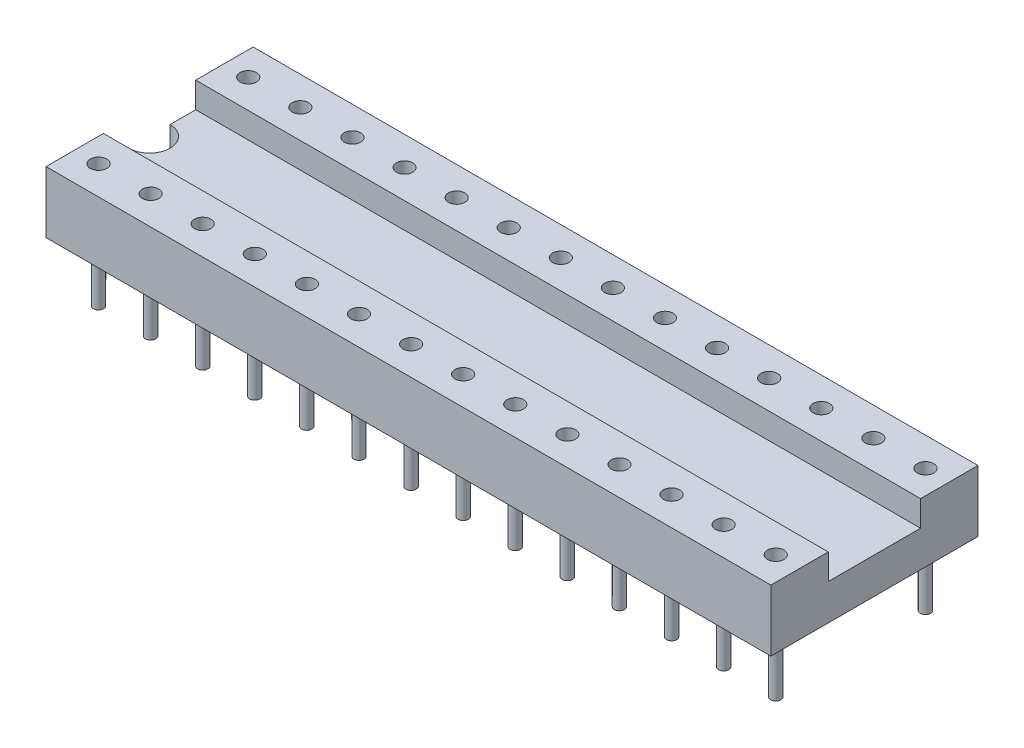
ISO-10303-21;
HEADER;
FILE_DESCRIPTION(('STEP AP214'),'2;1');
FILE_NAME('part.step','',(''),(''),'','','');
FILE_SCHEMA(('AUTOMOTIVE_DESIGN { 1 0 10303 214 1 1 1 1 }'));
ENDSEC;
DATA;
#1=APPLICATION_CONTEXT('core data for automotive mechanical design processes');
#2=APPLICATION_PROTOCOL_DEFINITION('international standard','automotive_design',2000,#1);
#3=PRODUCT_CONTEXT('',#1,'mechanical');
#4=PRODUCT('Part','Part','',(#3));
#5=PRODUCT_RELATED_PRODUCT_CATEGORY('part','',(#4));
#6=PRODUCT_DEFINITION_FORMATION('','',#4);
#7=PRODUCT_DEFINITION_CONTEXT('part definition',#1,'design');
#8=PRODUCT_DEFINITION('design','',#6,#7);
#9=PRODUCT_DEFINITION_SHAPE('','',#8);
#10=(LENGTH_UNIT() NAMED_UNIT(*) SI_UNIT(.MILLI.,.METRE.));
#11=(NAMED_UNIT(*) PLANE_ANGLE_UNIT() SI_UNIT($,.RADIAN.));
#12=(NAMED_UNIT(*) SI_UNIT($,.STERADIAN.) SOLID_ANGLE_UNIT());
#13=UNCERTAINTY_MEASURE_WITH_UNIT(LENGTH_MEASURE(1.E-05),#10,'distance_accuracy_value','');
#14=(GEOMETRIC_REPRESENTATION_CONTEXT(3) GLOBAL_UNCERTAINTY_ASSIGNED_CONTEXT((#13)) GLOBAL_UNIT_ASSIGNED_CONTEXT((#10,
#11,#12)) REPRESENTATION_CONTEXT('',''));
#15=CARTESIAN_POINT('',(0.,0.,0.));
#16=DIRECTION('',(0.,0.,1.));
#17=DIRECTION('',(1.,0.,0.));
#18=AXIS2_PLACEMENT_3D('',#15,#16,#17);
#19=CARTESIAN_POINT('',(35.34,0.,5.05));
#20=DIRECTION('',(0.,1.,0.));
#21=DIRECTION('',(0.,0.,1.));
#22=AXIS2_PLACEMENT_3D('',#19,#20,#21);
#23=PLANE('',#22);
#24=CARTESIAN_POINT('',(34.18,0.,3.65));
#25=DIRECTION('',(0.,1.,0.));
#26=DIRECTION('',(0.,0.,1.));
#27=AXIS2_PLACEMENT_3D('',#24,#25,#26);
#28=CIRCLE('',#27,0.25);
#29=CARTESIAN_POINT('',(34.18,0.,3.9));
#30=VERTEX_POINT('',#29);
#31=EDGE_CURVE('E40',#30,#30,#28,.F.);
#32=ORIENTED_EDGE('',*,*,#31,.F.);
#33=EDGE_LOOP('',(#32));
#34=FACE_BOUND('',#33,.T.);
#35=CARTESIAN_POINT('',(31.64,0.,3.65));
#36=DIRECTION('',(0.,1.,0.));
#37=DIRECTION('',(0.,0.,1.));
#38=AXIS2_PLACEMENT_3D('',#35,#36,#37);
#39=CIRCLE('',#38,0.25);
#40=CARTESIAN_POINT('',(31.64,0.,3.9));
#41=VERTEX_POINT('',#40);
#42=EDGE_CURVE('E258',#41,#41,#39,.F.);
#43=ORIENTED_EDGE('',*,*,#42,.F.);
#44=EDGE_LOOP('',(#43));
#45=FACE_BOUND('',#44,.T.);
#46=CARTESIAN_POINT('',(29.1,0.,3.65));
#47=DIRECTION('',(0.,1.,0.));
#48=DIRECTION('',(0.,0.,1.));
#49=AXIS2_PLACEMENT_3D('',#46,#47,#48);
#50=CIRCLE('',#49,0.25);
#51=CARTESIAN_POINT('',(29.1,0.,3.9));
#52=VERTEX_POINT('',#51);
#53=EDGE_CURVE('E252',#52,#52,#50,.F.);
#54=ORIENTED_EDGE('',*,*,#53,.F.);
#55=EDGE_LOOP('',(#54));
#56=FACE_BOUND('',#55,.T.);
#57=CARTESIAN_POINT('',(26.56,0.,3.65));
#58=DIRECTION('',(0.,1.,0.));
#59=DIRECTION('',(0.,0.,1.));
#60=AXIS2_PLACEMENT_3D('',#57,#58,#59);
#61=CIRCLE('',#60,0.25);
#62=CARTESIAN_POINT('',(26.56,0.,3.9));
#63=VERTEX_POINT('',#62);
#64=EDGE_CURVE('E246',#63,#63,#61,.F.);
#65=ORIENTED_EDGE('',*,*,#64,.F.);
#66=EDGE_LOOP('',(#65));
#67=FACE_BOUND('',#66,.T.);
#68=CARTESIAN_POINT('',(24.02,0.,3.65));
#69=DIRECTION('',(0.,1.,0.));
#70=DIRECTION('',(0.,0.,1.));
#71=AXIS2_PLACEMENT_3D('',#68,#69,#70);
#72=CIRCLE('',#71,0.25);
#73=CARTESIAN_POINT('',(24.02,0.,3.9));
#74=VERTEX_POINT('',#73);
#75=EDGE_CURVE('E240',#74,#74,#72,.F.);
#76=ORIENTED_EDGE('',*,*,#75,.F.);
#77=EDGE_LOOP('',(#76));
#78=FACE_BOUND('',#77,.T.);
#79=CARTESIAN_POINT('',(21.48,0.,3.65));
#80=DIRECTION('',(0.,1.,0.));
#81=DIRECTION('',(0.,0.,1.));
#82=AXIS2_PLACEMENT_3D('',#79,#80,#81);
#83=CIRCLE('',#82,0.25);
#84=CARTESIAN_POINT('',(21.48,0.,3.9));
#85=VERTEX_POINT('',#84);
#86=EDGE_CURVE('E234',#85,#85,#83,.F.);
#87=ORIENTED_EDGE('',*,*,#86,.F.);
#88=EDGE_LOOP('',(#87));
#89=FACE_BOUND('',#88,.T.);
#90=CARTESIAN_POINT('',(18.94,0.,3.65));
#91=DIRECTION('',(0.,1.,0.));
#92=DIRECTION('',(0.,0.,1.));
#93=AXIS2_PLACEMENT_3D('',#90,#91,#92);
#94=CIRCLE('',#93,0.25);
#95=CARTESIAN_POINT('',(18.94,0.,3.9));
#96=VERTEX_POINT('',#95);
#97=EDGE_CURVE('E228',#96,#96,#94,.F.);
#98=ORIENTED_EDGE('',*,*,#97,.F.);
#99=EDGE_LOOP('',(#98));
#100=FACE_BOUND('',#99,.T.);
#101=CARTESIAN_POINT('',(16.4,0.,3.65));
#102=DIRECTION('',(0.,1.,0.));
#103=DIRECTION('',(0.,0.,1.));
#104=AXIS2_PLACEMENT_3D('',#101,#102,#103);
#105=CIRCLE('',#104,0.25);
#106=CARTESIAN_POINT('',(16.4,0.,3.9));
#107=VERTEX_POINT('',#106);
#108=EDGE_CURVE('E222',#107,#107,#105,.F.);
#109=ORIENTED_EDGE('',*,*,#108,.F.);
#110=EDGE_LOOP('',(#109));
#111=FACE_BOUND('',#110,.T.);
#112=CARTESIAN_POINT('',(13.86,0.,3.65));
#113=DIRECTION('',(0.,1.,0.));
#114=DIRECTION('',(0.,0.,1.));
#115=AXIS2_PLACEMENT_3D('',#112,#113,#114);
#116=CIRCLE('',#115,0.25);
#117=CARTESIAN_POINT('',(13.86,0.,3.9));
#118=VERTEX_POINT('',#117);
#119=EDGE_CURVE('E216',#118,#118,#116,.F.);
#120=ORIENTED_EDGE('',*,*,#119,.F.);
#121=EDGE_LOOP('',(#120));
#122=FACE_BOUND('',#121,.T.);
#123=CARTESIAN_POINT('',(11.32,0.,3.65));
#124=DIRECTION('',(0.,1.,0.));
#125=DIRECTION('',(0.,0.,1.));
#126=AXIS2_PLACEMENT_3D('',#123,#124,#125);
#127=CIRCLE('',#126,0.25);
#128=CARTESIAN_POINT('',(11.32,0.,3.9));
#129=VERTEX_POINT('',#128);
#130=EDGE_CURVE('E210',#129,#129,#127,.F.);
#131=ORIENTED_EDGE('',*,*,#130,.F.);
#132=EDGE_LOOP('',(#131));
#133=FACE_BOUND('',#132,.T.);
#134=CARTESIAN_POINT('',(8.78,0.,3.65));
#135=DIRECTION('',(0.,1.,0.));
#136=DIRECTION('',(0.,0.,1.));
#137=AXIS2_PLACEMENT_3D('',#134,#135,#136);
#138=CIRCLE('',#137,0.25);
#139=CARTESIAN_POINT('',(8.78,0.,3.9));
#140=VERTEX_POINT('',#139);
#141=EDGE_CURVE('E204',#140,#140,#138,.F.);
#142=ORIENTED_EDGE('',*,*,#141,.F.);
#143=EDGE_LOOP('',(#142));
#144=FACE_BOUND('',#143,.T.);
#145=CARTESIAN_POINT('',(6.24,0.,3.65));
#146=DIRECTION('',(0.,1.,0.));
#147=DIRECTION('',(0.,0.,1.));
#148=AXIS2_PLACEMENT_3D('',#145,#146,#147);
#149=CIRCLE('',#148,0.25);
#150=CARTESIAN_POINT('',(6.24,0.,3.9));
#151=VERTEX_POINT('',#150);
#152=EDGE_CURVE('E198',#151,#151,#149,.F.);
#153=ORIENTED_EDGE('',*,*,#152,.F.);
#154=EDGE_LOOP('',(#153));
#155=FACE_BOUND('',#154,.T.);
#156=CARTESIAN_POINT('',(3.7,0.,3.65));
#157=DIRECTION('',(0.,1.,0.));
#158=DIRECTION('',(0.,0.,1.));
#159=AXIS2_PLACEMENT_3D('',#156,#157,#158);
#160=CIRCLE('',#159,0.25);
#161=CARTESIAN_POINT('',(3.7,0.,3.9));
#162=VERTEX_POINT('',#161);
#163=EDGE_CURVE('E192',#162,#162,#160,.F.);
#164=ORIENTED_EDGE('',*,*,#163,.F.);
#165=EDGE_LOOP('',(#164));
#166=FACE_BOUND('',#165,.T.);
#167=CARTESIAN_POINT('',(1.16,0.,3.65));
#168=DIRECTION('',(0.,1.,0.));
#169=DIRECTION('',(0.,0.,1.));
#170=AXIS2_PLACEMENT_3D('',#167,#168,#169);
#171=CIRCLE('',#170,0.25);
#172=CARTESIAN_POINT('',(1.16,0.,3.9));
#173=VERTEX_POINT('',#172);
#174=EDGE_CURVE('E186',#173,#173,#171,.F.);
#175=ORIENTED_EDGE('',*,*,#174,.F.);
#176=EDGE_LOOP('',(#175));
#177=FACE_BOUND('',#176,.T.);
#178=DIRECTION('',(0.,0.,-1.));
#179=VECTOR('',#178,1.);
#180=CARTESIAN_POINT('',(0.,0.,5.05));
#181=LINE('',#180,#179);
#182=CARTESIAN_POINT('',(0.,0.,5.05));
#183=VERTEX_POINT('',#182);
#184=CARTESIAN_POINT('',(0.,0.,1.));
#185=VERTEX_POINT('',#184);
#186=EDGE_CURVE('E140',#183,#185,#181,.T.);
#187=ORIENTED_EDGE('',*,*,#186,.T.);
#188=CARTESIAN_POINT('',(0.,0.,0.));
#189=DIRECTION('',(0.,1.,0.));
#190=DIRECTION('',(0.,0.,1.));
#191=AXIS2_PLACEMENT_3D('',#188,#189,#190);
#192=CIRCLE('',#191,1.);
#193=CARTESIAN_POINT('',(0.,0.,-1.));
#194=VERTEX_POINT('',#193);
#195=EDGE_CURVE('E47',#185,#194,#192,.T.);
#196=ORIENTED_EDGE('',*,*,#195,.T.);
#197=CARTESIAN_POINT('',(0.,0.,-5.05));
#198=VERTEX_POINT('',#197);
#199=EDGE_CURVE('E125',#194,#198,#181,.T.);
#200=ORIENTED_EDGE('',*,*,#199,.T.);
#201=DIRECTION('',(-1.,0.,0.));
#202=VECTOR('',#201,1.);
#203=CARTESIAN_POINT('',(35.34,0.,-5.05));
#204=LINE('',#203,#202);
#205=CARTESIAN_POINT('',(35.34,0.,-5.05));
#206=VERTEX_POINT('',#205);
#207=EDGE_CURVE('E171',#206,#198,#204,.T.);
#208=ORIENTED_EDGE('',*,*,#207,.F.);
#209=DIRECTION('',(0.,0.,-1.));
#210=VECTOR('',#209,1.);
#211=CARTESIAN_POINT('',(35.34,0.,5.05));
#212=LINE('',#211,#210);
#213=CARTESIAN_POINT('',(35.34,0.,5.05));
#214=VERTEX_POINT('',#213);
#215=EDGE_CURVE('E157',#214,#206,#212,.T.);
#216=ORIENTED_EDGE('',*,*,#215,.F.);
#217=DIRECTION('',(-1.,0.,0.));
#218=VECTOR('',#217,1.);
#219=CARTESIAN_POINT('',(35.34,0.,5.05));
#220=LINE('',#219,#218);
#221=EDGE_CURVE('E174',#214,#183,#220,.T.);
#222=ORIENTED_EDGE('',*,*,#221,.T.);
#223=EDGE_LOOP('',(#187,#196,#200,#208,#216,#222));
#224=FACE_BOUND('',#223,.T.);
#225=CARTESIAN_POINT('',(1.16,0.,-3.65));
#226=DIRECTION('',(0.,1.,0.));
#227=DIRECTION('',(0.,0.,1.));
#228=AXIS2_PLACEMENT_3D('',#225,#226,#227);
#229=CIRCLE('',#228,0.25);
#230=CARTESIAN_POINT('',(1.16,0.,-3.4));
#231=VERTEX_POINT('',#230);
#232=EDGE_CURVE('E189',#231,#231,#229,.F.);
#233=ORIENTED_EDGE('',*,*,#232,.F.);
#234=EDGE_LOOP('',(#233));
#235=FACE_BOUND('',#234,.T.);
#236=CARTESIAN_POINT('',(3.7,0.,-3.65));
#237=DIRECTION('',(0.,1.,0.));
#238=DIRECTION('',(0.,0.,1.));
#239=AXIS2_PLACEMENT_3D('',#236,#237,#238);
#240=CIRCLE('',#239,0.25);
#241=CARTESIAN_POINT('',(3.7,0.,-3.4));
#242=VERTEX_POINT('',#241);
#243=EDGE_CURVE('E195',#242,#242,#240,.F.);
#244=ORIENTED_EDGE('',*,*,#243,.F.);
#245=EDGE_LOOP('',(#244));
#246=FACE_BOUND('',#245,.T.);
#247=CARTESIAN_POINT('',(6.24,0.,-3.65));
#248=DIRECTION('',(0.,1.,0.));
#249=DIRECTION('',(0.,0.,1.));
#250=AXIS2_PLACEMENT_3D('',#247,#248,#249);
#251=CIRCLE('',#250,0.25);
#252=CARTESIAN_POINT('',(6.24,0.,-3.4));
#253=VERTEX_POINT('',#252);
#254=EDGE_CURVE('E201',#253,#253,#251,.F.);
#255=ORIENTED_EDGE('',*,*,#254,.F.);
#256=EDGE_LOOP('',(#255));
#257=FACE_BOUND('',#256,.T.);
#258=CARTESIAN_POINT('',(8.78,0.,-3.65));
#259=DIRECTION('',(0.,1.,0.));
#260=DIRECTION('',(0.,0.,1.));
#261=AXIS2_PLACEMENT_3D('',#258,#259,#260);
#262=CIRCLE('',#261,0.25);
#263=CARTESIAN_POINT('',(8.78,0.,-3.4));
#264=VERTEX_POINT('',#263);
#265=EDGE_CURVE('E207',#264,#264,#262,.F.);
#266=ORIENTED_EDGE('',*,*,#265,.F.);
#267=EDGE_LOOP('',(#266));
#268=FACE_BOUND('',#267,.T.);
#269=CARTESIAN_POINT('',(11.32,0.,-3.65));
#270=DIRECTION('',(0.,1.,0.));
#271=DIRECTION('',(0.,0.,1.));
#272=AXIS2_PLACEMENT_3D('',#269,#270,#271);
#273=CIRCLE('',#272,0.25);
#274=CARTESIAN_POINT('',(11.32,0.,-3.4));
#275=VERTEX_POINT('',#274);
#276=EDGE_CURVE('E213',#275,#275,#273,.F.);
#277=ORIENTED_EDGE('',*,*,#276,.F.);
#278=EDGE_LOOP('',(#277));
#279=FACE_BOUND('',#278,.T.);
#280=CARTESIAN_POINT('',(13.86,0.,-3.65));
#281=DIRECTION('',(0.,1.,0.));
#282=DIRECTION('',(0.,0.,1.));
#283=AXIS2_PLACEMENT_3D('',#280,#281,#282);
#284=CIRCLE('',#283,0.25);
#285=CARTESIAN_POINT('',(13.86,0.,-3.4));
#286=VERTEX_POINT('',#285);
#287=EDGE_CURVE('E219',#286,#286,#284,.F.);
#288=ORIENTED_EDGE('',*,*,#287,.F.);
#289=EDGE_LOOP('',(#288));
#290=FACE_BOUND('',#289,.T.);
#291=CARTESIAN_POINT('',(16.4,0.,-3.65));
#292=DIRECTION('',(0.,1.,0.));
#293=DIRECTION('',(0.,0.,1.));
#294=AXIS2_PLACEMENT_3D('',#291,#292,#293);
#295=CIRCLE('',#294,0.25);
#296=CARTESIAN_POINT('',(16.4,0.,-3.4));
#297=VERTEX_POINT('',#296);
#298=EDGE_CURVE('E225',#297,#297,#295,.F.);
#299=ORIENTED_EDGE('',*,*,#298,.F.);
#300=EDGE_LOOP('',(#299));
#301=FACE_BOUND('',#300,.T.);
#302=CARTESIAN_POINT('',(18.94,0.,-3.65));
#303=DIRECTION('',(0.,1.,0.));
#304=DIRECTION('',(0.,0.,1.));
#305=AXIS2_PLACEMENT_3D('',#302,#303,#304);
#306=CIRCLE('',#305,0.25);
#307=CARTESIAN_POINT('',(18.94,0.,-3.4));
#308=VERTEX_POINT('',#307);
#309=EDGE_CURVE('E231',#308,#308,#306,.F.);
#310=ORIENTED_EDGE('',*,*,#309,.F.);
#311=EDGE_LOOP('',(#310));
#312=FACE_BOUND('',#311,.T.);
#313=CARTESIAN_POINT('',(21.48,0.,-3.65));
#314=DIRECTION('',(0.,1.,0.));
#315=DIRECTION('',(0.,0.,1.));
#316=AXIS2_PLACEMENT_3D('',#313,#314,#315);
#317=CIRCLE('',#316,0.25);
#318=CARTESIAN_POINT('',(21.48,0.,-3.4));
#319=VERTEX_POINT('',#318);
#320=EDGE_CURVE('E237',#319,#319,#317,.F.);
#321=ORIENTED_EDGE('',*,*,#320,.F.);
#322=EDGE_LOOP('',(#321));
#323=FACE_BOUND('',#322,.T.);
#324=CARTESIAN_POINT('',(24.02,0.,-3.65));
#325=DIRECTION('',(0.,1.,0.));
#326=DIRECTION('',(0.,0.,1.));
#327=AXIS2_PLACEMENT_3D('',#324,#325,#326);
#328=CIRCLE('',#327,0.25);
#329=CARTESIAN_POINT('',(24.02,0.,-3.4));
#330=VERTEX_POINT('',#329);
#331=EDGE_CURVE('E243',#330,#330,#328,.F.);
#332=ORIENTED_EDGE('',*,*,#331,.F.);
#333=EDGE_LOOP('',(#332));
#334=FACE_BOUND('',#333,.T.);
#335=CARTESIAN_POINT('',(26.56,0.,-3.65));
#336=DIRECTION('',(0.,1.,0.));
#337=DIRECTION('',(0.,0.,1.));
#338=AXIS2_PLACEMENT_3D('',#335,#336,#337);
#339=CIRCLE('',#338,0.25);
#340=CARTESIAN_POINT('',(26.56,0.,-3.4));
#341=VERTEX_POINT('',#340);
#342=EDGE_CURVE('E249',#341,#341,#339,.F.);
#343=ORIENTED_EDGE('',*,*,#342,.F.);
#344=EDGE_LOOP('',(#343));
#345=FACE_BOUND('',#344,.T.);
#346=CARTESIAN_POINT('',(29.1,0.,-3.65));
#347=DIRECTION('',(0.,1.,0.));
#348=DIRECTION('',(0.,0.,1.));
#349=AXIS2_PLACEMENT_3D('',#346,#347,#348);
#350=CIRCLE('',#349,0.25);
#351=CARTESIAN_POINT('',(29.1,0.,-3.4));
#352=VERTEX_POINT('',#351);
#353=EDGE_CURVE('E255',#352,#352,#350,.F.);
#354=ORIENTED_EDGE('',*,*,#353,.F.);
#355=EDGE_LOOP('',(#354));
#356=FACE_BOUND('',#355,.T.);
#357=CARTESIAN_POINT('',(31.64,0.,-3.65));
#358=DIRECTION('',(0.,1.,0.));
#359=DIRECTION('',(0.,0.,1.));
#360=AXIS2_PLACEMENT_3D('',#357,#358,#359);
#361=CIRCLE('',#360,0.25);
#362=CARTESIAN_POINT('',(31.64,0.,-3.4));
#363=VERTEX_POINT('',#362);
#364=EDGE_CURVE('E261',#363,#363,#361,.F.);
#365=ORIENTED_EDGE('',*,*,#364,.F.);
#366=EDGE_LOOP('',(#365));
#367=FACE_BOUND('',#366,.T.);
#368=CARTESIAN_POINT('',(34.18,0.,-3.65));
#369=DIRECTION('',(0.,1.,0.));
#370=DIRECTION('',(0.,0.,1.));
#371=AXIS2_PLACEMENT_3D('',#368,#369,#370);
#372=CIRCLE('',#371,0.25);
#373=CARTESIAN_POINT('',(34.18,0.,-3.4));
#374=VERTEX_POINT('',#373);
#375=EDGE_CURVE('E11',#374,#374,#372,.F.);
#376=ORIENTED_EDGE('',*,*,#375,.F.);
#377=EDGE_LOOP('',(#376));
#378=FACE_BOUND('',#377,.T.);
#379=ADVANCED_FACE('F32',(#34,#45,#56,#67,#78,#89,#100,#111,#122,#133,#144,#155,#166,#177,#224,
#235,#246,#257,#268,#279,#290,#301,#312,#323,#334,#345,#356,#367,#378),#23,.F.);
#380=CARTESIAN_POINT('',(0.,1.75,5.05));
#381=DIRECTION('',(1.,0.,0.));
#382=DIRECTION('',(0.,0.,-1.));
#383=AXIS2_PLACEMENT_3D('',#380,#381,#382);
#384=PLANE('',#383);
#385=ORIENTED_EDGE('',*,*,#199,.F.);
#386=DIRECTION('',(0.,1.,0.));
#387=VECTOR('',#386,1.);
#388=CARTESIAN_POINT('',(0.,0.,-1.));
#389=LINE('',#388,#387);
#390=CARTESIAN_POINT('',(0.,1.75,-1.));
#391=VERTEX_POINT('',#390);
#392=EDGE_CURVE('E111',#194,#391,#389,.T.);
#393=ORIENTED_EDGE('',*,*,#392,.T.);
#394=DIRECTION('',(0.,0.,1.));
#395=VECTOR('',#394,1.);
#396=CARTESIAN_POINT('',(0.,1.75,-2.25));
#397=LINE('',#396,#395);
#398=CARTESIAN_POINT('',(0.,1.75,-2.25));
#399=VERTEX_POINT('',#398);
#400=EDGE_CURVE('E123',#399,#391,#397,.T.);
#401=ORIENTED_EDGE('',*,*,#400,.F.);
#402=DIRECTION('',(0.,-1.,0.));
#403=VECTOR('',#402,1.);
#404=CARTESIAN_POINT('',(0.,3.,-2.25));
#405=LINE('',#404,#403);
#406=CARTESIAN_POINT('',(0.,3.,-2.25));
#407=VERTEX_POINT('',#406);
#408=EDGE_CURVE('E147',#407,#399,#405,.T.);
#409=ORIENTED_EDGE('',*,*,#408,.F.);
#410=DIRECTION('',(0.,0.,1.));
#411=VECTOR('',#410,1.);
#412=CARTESIAN_POINT('',(0.,3.,-5.05));
#413=LINE('',#412,#411);
#414=CARTESIAN_POINT('',(0.,3.,-5.05));
#415=VERTEX_POINT('',#414);
#416=EDGE_CURVE('E145',#415,#407,#413,.T.);
#417=ORIENTED_EDGE('',*,*,#416,.F.);
#418=DIRECTION('',(0.,1.,0.));
#419=VECTOR('',#418,1.);
#420=CARTESIAN_POINT('',(0.,0.,-5.05));
#421=LINE('',#420,#419);
#422=EDGE_CURVE('E143',#198,#415,#421,.T.);
#423=ORIENTED_EDGE('',*,*,#422,.F.);
#424=EDGE_LOOP('',(#385,#393,#401,#409,#417,#423));
#425=FACE_BOUND('',#424,.T.);
#426=ADVANCED_FACE('F121',(#425),#384,.F.);
#427=CARTESIAN_POINT('',(35.34,1.75,-2.25));
#428=DIRECTION('',(0.,-1.,0.));
#429=DIRECTION('',(0.,0.,-1.));
#430=AXIS2_PLACEMENT_3D('',#427,#428,#429);
#431=PLANE('',#430);
#432=ORIENTED_EDGE('',*,*,#400,.T.);
#433=CARTESIAN_POINT('',(0.,1.75,0.));
#434=DIRECTION('',(0.,1.,0.));
#435=DIRECTION('',(0.,0.,1.));
#436=AXIS2_PLACEMENT_3D('',#433,#434,#435);
#437=CIRCLE('',#436,1.);
#438=CARTESIAN_POINT('',(0.,1.75,1.));
#439=VERTEX_POINT('',#438);
#440=EDGE_CURVE('E108',#439,#391,#437,.T.);
#441=ORIENTED_EDGE('',*,*,#440,.F.);
#442=CARTESIAN_POINT('',(0.,1.75,2.25));
#443=VERTEX_POINT('',#442);
#444=EDGE_CURVE('E131',#439,#443,#397,.T.);
#445=ORIENTED_EDGE('',*,*,#444,.T.);
#446=DIRECTION('',(-1.,0.,0.));
#447=VECTOR('',#446,1.);
#448=CARTESIAN_POINT('',(35.34,1.75,2.25));
#449=LINE('',#448,#447);
#450=CARTESIAN_POINT('',(35.34,1.75,2.25));
#451=VERTEX_POINT('',#450);
#452=EDGE_CURVE('E183',#451,#443,#449,.T.);
#453=ORIENTED_EDGE('',*,*,#452,.F.);
#454=DIRECTION('',(0.,0.,1.));
#455=VECTOR('',#454,1.);
#456=CARTESIAN_POINT('',(35.34,1.75,-2.25));
#457=LINE('',#456,#455);
#458=CARTESIAN_POINT('',(35.34,1.75,-2.25));
#459=VERTEX_POINT('',#458);
#460=EDGE_CURVE('E149',#459,#451,#457,.T.);
#461=ORIENTED_EDGE('',*,*,#460,.F.);
#462=DIRECTION('',(-1.,0.,0.));
#463=VECTOR('',#462,1.);
#464=CARTESIAN_POINT('',(35.34,1.75,-2.25));
#465=LINE('',#464,#463);
#466=EDGE_CURVE('E129',#459,#399,#465,.T.);
#467=ORIENTED_EDGE('',*,*,#466,.T.);
#468=EDGE_LOOP('',(#432,#441,#445,#453,#461,#467));
#469=FACE_BOUND('',#468,.T.);
#470=ADVANCED_FACE('F34',(#469),#431,.F.);
#471=CARTESIAN_POINT('',(35.34,1.75,2.25));
#472=DIRECTION('',(0.,0.,1.));
#473=DIRECTION('',(0.,-1.,0.));
#474=AXIS2_PLACEMENT_3D('',#471,#472,#473);
#475=PLANE('',#474);
#476=DIRECTION('',(0.,1.,0.));
#477=VECTOR('',#476,1.);
#478=CARTESIAN_POINT('',(0.,1.75,2.25));
#479=LINE('',#478,#477);
#480=CARTESIAN_POINT('',(0.,3.,2.25));
#481=VERTEX_POINT('',#480);
#482=EDGE_CURVE('E130',#443,#481,#479,.T.);
#483=ORIENTED_EDGE('',*,*,#482,.T.);
#484=DIRECTION('',(-1.,0.,0.));
#485=VECTOR('',#484,1.);
#486=CARTESIAN_POINT('',(35.34,3.,2.25));
#487=LINE('',#486,#485);
#488=CARTESIAN_POINT('',(35.34,3.,2.25));
#489=VERTEX_POINT('',#488);
#490=EDGE_CURVE('E180',#489,#481,#487,.T.);
#491=ORIENTED_EDGE('',*,*,#490,.F.);
#492=DIRECTION('',(0.,1.,0.));
#493=VECTOR('',#492,1.);
#494=CARTESIAN_POINT('',(35.34,1.75,2.25));
#495=LINE('',#494,#493);
#496=EDGE_CURVE('E151',#451,#489,#495,.T.);
#497=ORIENTED_EDGE('',*,*,#496,.F.);
#498=ORIENTED_EDGE('',*,*,#452,.T.);
#499=EDGE_LOOP('',(#483,#491,#497,#498));
#500=FACE_BOUND('',#499,.T.);
#501=ADVANCED_FACE('F805',(#500),#475,.F.);
#502=CARTESIAN_POINT('',(35.34,3.,2.25));
#503=DIRECTION('',(0.,-1.,0.));
#504=DIRECTION('',(0.,0.,-1.));
#505=AXIS2_PLACEMENT_3D('',#502,#503,#504);
#506=PLANE('',#505);
#507=CARTESIAN_POINT('',(34.18,3.,3.64999999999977));
#508=DIRECTION('',(0.,1.,0.));
#509=DIRECTION('',(0.,0.,1.));
#510=AXIS2_PLACEMENT_3D('',#507,#508,#509);
#511=CIRCLE('',#510,0.400000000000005);
#512=CARTESIAN_POINT('',(34.18,3.,4.04999999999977));
#513=VERTEX_POINT('',#512);
#514=EDGE_CURVE('E986',#513,#513,#511,.T.);
#515=ORIENTED_EDGE('',*,*,#514,.F.);
#516=EDGE_LOOP('',(#515));
#517=FACE_BOUND('',#516,.T.);
#518=CARTESIAN_POINT('',(31.64,3.,3.64999999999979));
#519=DIRECTION('',(0.,1.,0.));
#520=DIRECTION('',(0.,0.,1.));
#521=AXIS2_PLACEMENT_3D('',#518,#519,#520);
#522=CIRCLE('',#521,0.400000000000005);
#523=CARTESIAN_POINT('',(31.64,3.,4.04999999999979));
#524=VERTEX_POINT('',#523);
#525=EDGE_CURVE('E974',#524,#524,#522,.T.);
#526=ORIENTED_EDGE('',*,*,#525,.F.);
#527=EDGE_LOOP('',(#526));
#528=FACE_BOUND('',#527,.T.);
#529=CARTESIAN_POINT('',(29.1,3.,3.6499999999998));
#530=DIRECTION('',(0.,1.,0.));
#531=DIRECTION('',(0.,0.,1.));
#532=AXIS2_PLACEMENT_3D('',#529,#530,#531);
#533=CIRCLE('',#532,0.400000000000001);
#534=CARTESIAN_POINT('',(29.1,3.,4.04999999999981));
#535=VERTEX_POINT('',#534);
#536=EDGE_CURVE('E962',#535,#535,#533,.T.);
#537=ORIENTED_EDGE('',*,*,#536,.F.);
#538=EDGE_LOOP('',(#537));
#539=FACE_BOUND('',#538,.T.);
#540=CARTESIAN_POINT('',(26.56,3.,3.64999999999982));
#541=DIRECTION('',(0.,1.,0.));
#542=DIRECTION('',(0.,0.,1.));
#543=AXIS2_PLACEMENT_3D('',#540,#541,#542);
#544=CIRCLE('',#543,0.400000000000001);
#545=CARTESIAN_POINT('',(26.56,3.,4.04999999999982));
#546=VERTEX_POINT('',#545);
#547=EDGE_CURVE('E950',#546,#546,#544,.T.);
#548=ORIENTED_EDGE('',*,*,#547,.F.);
#549=EDGE_LOOP('',(#548));
#550=FACE_BOUND('',#549,.T.);
#551=CARTESIAN_POINT('',(24.02,3.,3.64999999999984));
#552=DIRECTION('',(0.,1.,0.));
#553=DIRECTION('',(0.,0.,1.));
#554=AXIS2_PLACEMENT_3D('',#551,#552,#553);
#555=CIRCLE('',#554,0.400000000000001);
#556=CARTESIAN_POINT('',(24.02,3.,4.04999999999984));
#557=VERTEX_POINT('',#556);
#558=EDGE_CURVE('E938',#557,#557,#555,.T.);
#559=ORIENTED_EDGE('',*,*,#558,.F.);
#560=EDGE_LOOP('',(#559));
#561=FACE_BOUND('',#560,.T.);
#562=CARTESIAN_POINT('',(21.48,3.,3.64999999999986));
#563=DIRECTION('',(0.,1.,0.));
#564=DIRECTION('',(0.,0.,1.));
#565=AXIS2_PLACEMENT_3D('',#562,#563,#564);
#566=CIRCLE('',#565,0.400000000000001);
#567=CARTESIAN_POINT('',(21.48,3.,4.04999999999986));
#568=VERTEX_POINT('',#567);
#569=EDGE_CURVE('E926',#568,#568,#566,.T.);
#570=ORIENTED_EDGE('',*,*,#569,.F.);
#571=EDGE_LOOP('',(#570));
#572=FACE_BOUND('',#571,.T.);
#573=CARTESIAN_POINT('',(18.94,3.,3.64999999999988));
#574=DIRECTION('',(0.,1.,0.));
#575=DIRECTION('',(0.,0.,1.));
#576=AXIS2_PLACEMENT_3D('',#573,#574,#575);
#577=CIRCLE('',#576,0.400000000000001);
#578=CARTESIAN_POINT('',(18.94,3.,4.04999999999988));
#579=VERTEX_POINT('',#578);
#580=EDGE_CURVE('E914',#579,#579,#577,.T.);
#581=ORIENTED_EDGE('',*,*,#580,.F.);
#582=EDGE_LOOP('',(#581));
#583=FACE_BOUND('',#582,.T.);
#584=CARTESIAN_POINT('',(16.4,3.,3.64999999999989));
#585=DIRECTION('',(0.,1.,0.));
#586=DIRECTION('',(0.,0.,1.));
#587=AXIS2_PLACEMENT_3D('',#584,#585,#586);
#588=CIRCLE('',#587,0.400000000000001);
#589=CARTESIAN_POINT('',(16.4,3.,4.0499999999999));
#590=VERTEX_POINT('',#589);
#591=EDGE_CURVE('E902',#590,#590,#588,.T.);
#592=ORIENTED_EDGE('',*,*,#591,.F.);
#593=EDGE_LOOP('',(#592));
#594=FACE_BOUND('',#593,.T.);
#595=CARTESIAN_POINT('',(13.86,3.,3.64999999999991));
#596=DIRECTION('',(0.,1.,0.));
#597=DIRECTION('',(0.,0.,1.));
#598=AXIS2_PLACEMENT_3D('',#595,#596,#597);
#599=CIRCLE('',#598,0.4);
#600=CARTESIAN_POINT('',(13.86,3.,4.04999999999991));
#601=VERTEX_POINT('',#600);
#602=EDGE_CURVE('E890',#601,#601,#599,.T.);
#603=ORIENTED_EDGE('',*,*,#602,.F.);
#604=EDGE_LOOP('',(#603));
#605=FACE_BOUND('',#604,.T.);
#606=CARTESIAN_POINT('',(11.32,3.,3.64999999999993));
#607=DIRECTION('',(0.,1.,0.));
#608=DIRECTION('',(0.,0.,1.));
#609=AXIS2_PLACEMENT_3D('',#606,#607,#608);
#610=CIRCLE('',#609,0.4);
#611=CARTESIAN_POINT('',(11.32,3.,4.04999999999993));
#612=VERTEX_POINT('',#611);
#613=EDGE_CURVE('E878',#612,#612,#610,.T.);
#614=ORIENTED_EDGE('',*,*,#613,.F.);
#615=EDGE_LOOP('',(#614));
#616=FACE_BOUND('',#615,.T.);
#617=CARTESIAN_POINT('',(8.78,3.,3.64999999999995));
#618=DIRECTION('',(0.,1.,0.));
#619=DIRECTION('',(0.,0.,1.));
#620=AXIS2_PLACEMENT_3D('',#617,#618,#619);
#621=CIRCLE('',#620,0.4);
#622=CARTESIAN_POINT('',(8.78,3.,4.04999999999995));
#623=VERTEX_POINT('',#622);
#624=EDGE_CURVE('E866',#623,#623,#621,.T.);
#625=ORIENTED_EDGE('',*,*,#624,.F.);
#626=EDGE_LOOP('',(#625));
#627=FACE_BOUND('',#626,.T.);
#628=CARTESIAN_POINT('',(6.24,3.,3.64999999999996));
#629=DIRECTION('',(0.,1.,0.));
#630=DIRECTION('',(0.,0.,1.));
#631=AXIS2_PLACEMENT_3D('',#628,#629,#630);
#632=CIRCLE('',#631,0.4);
#633=CARTESIAN_POINT('',(6.24,3.,4.04999999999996));
#634=VERTEX_POINT('',#633);
#635=EDGE_CURVE('E854',#634,#634,#632,.T.);
#636=ORIENTED_EDGE('',*,*,#635,.F.);
#637=EDGE_LOOP('',(#636));
#638=FACE_BOUND('',#637,.T.);
#639=CARTESIAN_POINT('',(3.7,3.,3.64999999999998));
#640=DIRECTION('',(0.,1.,0.));
#641=DIRECTION('',(0.,0.,1.));
#642=AXIS2_PLACEMENT_3D('',#639,#640,#641);
#643=CIRCLE('',#642,0.4);
#644=CARTESIAN_POINT('',(3.7,3.,4.04999999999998));
#645=VERTEX_POINT('',#644);
#646=EDGE_CURVE('E842',#645,#645,#643,.T.);
#647=ORIENTED_EDGE('',*,*,#646,.F.);
#648=EDGE_LOOP('',(#647));
#649=FACE_BOUND('',#648,.T.);
#650=CARTESIAN_POINT('',(1.16,3.,3.65));
#651=DIRECTION('',(0.,1.,0.));
#652=DIRECTION('',(0.,0.,1.));
#653=AXIS2_PLACEMENT_3D('',#650,#651,#652);
#654=CIRCLE('',#653,0.4);
#655=CARTESIAN_POINT('',(1.16,3.,4.05));
#656=VERTEX_POINT('',#655);
#657=EDGE_CURVE('E830',#656,#656,#654,.T.);
#658=ORIENTED_EDGE('',*,*,#657,.F.);
#659=EDGE_LOOP('',(#658));
#660=FACE_BOUND('',#659,.T.);
#661=DIRECTION('',(0.,0.,1.));
#662=VECTOR('',#661,1.);
#663=CARTESIAN_POINT('',(0.,3.,2.25));
#664=LINE('',#663,#662);
#665=CARTESIAN_POINT('',(0.,3.,5.05));
#666=VERTEX_POINT('',#665);
#667=EDGE_CURVE('E133',#481,#666,#664,.T.);
#668=ORIENTED_EDGE('',*,*,#667,.T.);
#669=DIRECTION('',(-1.,0.,0.));
#670=VECTOR('',#669,1.);
#671=CARTESIAN_POINT('',(35.34,3.,5.05));
#672=LINE('',#671,#670);
#673=CARTESIAN_POINT('',(35.34,3.,5.05));
#674=VERTEX_POINT('',#673);
#675=EDGE_CURVE('E177',#674,#666,#672,.T.);
#676=ORIENTED_EDGE('',*,*,#675,.F.);
#677=DIRECTION('',(0.,0.,1.));
#678=VECTOR('',#677,1.);
#679=CARTESIAN_POINT('',(35.34,3.,2.25));
#680=LINE('',#679,#678);
#681=EDGE_CURVE('E153',#489,#674,#680,.T.);
#682=ORIENTED_EDGE('',*,*,#681,.F.);
#683=ORIENTED_EDGE('',*,*,#490,.T.);
#684=EDGE_LOOP('',(#668,#676,#682,#683));
#685=FACE_BOUND('',#684,.T.);
#686=ADVANCED_FACE('F802',(#517,#528,#539,#550,#561,#572,#583,#594,#605,#616,#627,#638,#649,
#660,#685),#506,.F.);
#687=CARTESIAN_POINT('',(35.34,3.,5.05));
#688=DIRECTION('',(0.,0.,-1.));
#689=DIRECTION('',(-1.,0.,0.));
#690=AXIS2_PLACEMENT_3D('',#687,#688,#689);
#691=PLANE('',#690);
#692=DIRECTION('',(0.,-1.,0.));
#693=VECTOR('',#692,1.);
#694=CARTESIAN_POINT('',(0.,3.,5.05));
#695=LINE('',#694,#693);
#696=EDGE_CURVE('E138',#666,#183,#695,.T.);
#697=ORIENTED_EDGE('',*,*,#696,.T.);
#698=ORIENTED_EDGE('',*,*,#221,.F.);
#699=DIRECTION('',(0.,-1.,0.));
#700=VECTOR('',#699,1.);
#701=CARTESIAN_POINT('',(35.34,3.,5.05));
#702=LINE('',#701,#700);
#703=EDGE_CURVE('E155',#674,#214,#702,.T.);
#704=ORIENTED_EDGE('',*,*,#703,.F.);
#705=ORIENTED_EDGE('',*,*,#675,.T.);
#706=EDGE_LOOP('',(#697,#698,#704,#705));
#707=FACE_BOUND('',#706,.T.);
#708=ADVANCED_FACE('F797',(#707),#691,.F.);
#709=CARTESIAN_POINT('',(35.34,0.,-5.05));
#710=DIRECTION('',(0.,0.,1.));
#711=DIRECTION('',(0.,-1.,0.));
#712=AXIS2_PLACEMENT_3D('',#709,#710,#711);
#713=PLANE('',#712);
#714=ORIENTED_EDGE('',*,*,#422,.T.);
#715=DIRECTION('',(-1.,0.,0.));
#716=VECTOR('',#715,1.);
#717=CARTESIAN_POINT('',(35.34,3.,-5.05));
#718=LINE('',#717,#716);
#719=CARTESIAN_POINT('',(35.34,3.,-5.05));
#720=VERTEX_POINT('',#719);
#721=EDGE_CURVE('E168',#720,#415,#718,.T.);
#722=ORIENTED_EDGE('',*,*,#721,.F.);
#723=DIRECTION('',(0.,1.,0.));
#724=VECTOR('',#723,1.);
#725=CARTESIAN_POINT('',(35.34,0.,-5.05));
#726=LINE('',#725,#724);
#727=EDGE_CURVE('E159',#206,#720,#726,.T.);
#728=ORIENTED_EDGE('',*,*,#727,.F.);
#729=ORIENTED_EDGE('',*,*,#207,.T.);
#730=EDGE_LOOP('',(#714,#722,#728,#729));
#731=FACE_BOUND('',#730,.T.);
#732=ADVANCED_FACE('F794',(#731),#713,.F.);
#733=CARTESIAN_POINT('',(35.34,3.,-5.05));
#734=DIRECTION('',(0.,-1.,0.));
#735=DIRECTION('',(0.,0.,-1.));
#736=AXIS2_PLACEMENT_3D('',#733,#734,#735);
#737=PLANE('',#736);
#738=CARTESIAN_POINT('',(34.18,3.,-3.65000000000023));
#739=DIRECTION('',(0.,1.,0.));
#740=DIRECTION('',(0.,0.,-1.));
#741=AXIS2_PLACEMENT_3D('',#738,#739,#740);
#742=CIRCLE('',#741,0.400000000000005);
#743=CARTESIAN_POINT('',(34.18,3.,-4.05000000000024));
#744=VERTEX_POINT('',#743);
#745=EDGE_CURVE('E992',#744,#744,#742,.T.);
#746=ORIENTED_EDGE('',*,*,#745,.F.);
#747=EDGE_LOOP('',(#746));
#748=FACE_BOUND('',#747,.T.);
#749=CARTESIAN_POINT('',(31.64,3.,-3.65000000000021));
#750=DIRECTION('',(0.,1.,0.));
#751=DIRECTION('',(0.,0.,-1.));
#752=AXIS2_PLACEMENT_3D('',#749,#750,#751);
#753=CIRCLE('',#752,0.400000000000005);
#754=CARTESIAN_POINT('',(31.64,3.,-4.05000000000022));
#755=VERTEX_POINT('',#754);
#756=EDGE_CURVE('E980',#755,#755,#753,.T.);
#757=ORIENTED_EDGE('',*,*,#756,.F.);
#758=EDGE_LOOP('',(#757));
#759=FACE_BOUND('',#758,.T.);
#760=CARTESIAN_POINT('',(29.1,3.,-3.65000000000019));
#761=DIRECTION('',(0.,1.,0.));
#762=DIRECTION('',(0.,0.,-1.));
#763=AXIS2_PLACEMENT_3D('',#760,#761,#762);
#764=CIRCLE('',#763,0.400000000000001);
#765=CARTESIAN_POINT('',(29.1,3.,-4.0500000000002));
#766=VERTEX_POINT('',#765);
#767=EDGE_CURVE('E968',#766,#766,#764,.T.);
#768=ORIENTED_EDGE('',*,*,#767,.F.);
#769=EDGE_LOOP('',(#768));
#770=FACE_BOUND('',#769,.T.);
#771=CARTESIAN_POINT('',(26.56,3.,-3.65000000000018));
#772=DIRECTION('',(0.,1.,0.));
#773=DIRECTION('',(0.,0.,-1.));
#774=AXIS2_PLACEMENT_3D('',#771,#772,#773);
#775=CIRCLE('',#774,0.400000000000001);
#776=CARTESIAN_POINT('',(26.56,3.,-4.05000000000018));
#777=VERTEX_POINT('',#776);
#778=EDGE_CURVE('E956',#777,#777,#775,.T.);
#779=ORIENTED_EDGE('',*,*,#778,.F.);
#780=EDGE_LOOP('',(#779));
#781=FACE_BOUND('',#780,.T.);
#782=CARTESIAN_POINT('',(24.02,3.,-3.65000000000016));
#783=DIRECTION('',(0.,1.,0.));
#784=DIRECTION('',(0.,0.,-1.));
#785=AXIS2_PLACEMENT_3D('',#782,#783,#784);
#786=CIRCLE('',#785,0.400000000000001);
#787=CARTESIAN_POINT('',(24.02,3.,-4.05000000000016));
#788=VERTEX_POINT('',#787);
#789=EDGE_CURVE('E944',#788,#788,#786,.T.);
#790=ORIENTED_EDGE('',*,*,#789,.F.);
#791=EDGE_LOOP('',(#790));
#792=FACE_BOUND('',#791,.T.);
#793=CARTESIAN_POINT('',(21.48,3.,-3.65000000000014));
#794=DIRECTION('',(0.,1.,0.));
#795=DIRECTION('',(0.,0.,-1.));
#796=AXIS2_PLACEMENT_3D('',#793,#794,#795);
#797=CIRCLE('',#796,0.400000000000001);
#798=CARTESIAN_POINT('',(21.48,3.,-4.05000000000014));
#799=VERTEX_POINT('',#798);
#800=EDGE_CURVE('E932',#799,#799,#797,.T.);
#801=ORIENTED_EDGE('',*,*,#800,.F.);
#802=EDGE_LOOP('',(#801));
#803=FACE_BOUND('',#802,.T.);
#804=CARTESIAN_POINT('',(18.94,3.,-3.65000000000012));
#805=DIRECTION('',(0.,1.,0.));
#806=DIRECTION('',(0.,0.,-1.));
#807=AXIS2_PLACEMENT_3D('',#804,#805,#806);
#808=CIRCLE('',#807,0.400000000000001);
#809=CARTESIAN_POINT('',(18.94,3.,-4.05000000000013));
#810=VERTEX_POINT('',#809);
#811=EDGE_CURVE('E920',#810,#810,#808,.T.);
#812=ORIENTED_EDGE('',*,*,#811,.F.);
#813=EDGE_LOOP('',(#812));
#814=FACE_BOUND('',#813,.T.);
#815=CARTESIAN_POINT('',(16.4,3.,-3.65000000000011));
#816=DIRECTION('',(0.,1.,0.));
#817=DIRECTION('',(0.,0.,-1.));
#818=AXIS2_PLACEMENT_3D('',#815,#816,#817);
#819=CIRCLE('',#818,0.400000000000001);
#820=CARTESIAN_POINT('',(16.4,3.,-4.05000000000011));
#821=VERTEX_POINT('',#820);
#822=EDGE_CURVE('E908',#821,#821,#819,.T.);
#823=ORIENTED_EDGE('',*,*,#822,.F.);
#824=EDGE_LOOP('',(#823));
#825=FACE_BOUND('',#824,.T.);
#826=CARTESIAN_POINT('',(13.86,3.,-3.65000000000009));
#827=DIRECTION('',(0.,1.,0.));
#828=DIRECTION('',(0.,0.,-1.));
#829=AXIS2_PLACEMENT_3D('',#826,#827,#828);
#830=CIRCLE('',#829,0.4);
#831=CARTESIAN_POINT('',(13.86,3.,-4.05000000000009));
#832=VERTEX_POINT('',#831);
#833=EDGE_CURVE('E896',#832,#832,#830,.T.);
#834=ORIENTED_EDGE('',*,*,#833,.F.);
#835=EDGE_LOOP('',(#834));
#836=FACE_BOUND('',#835,.T.);
#837=CARTESIAN_POINT('',(11.32,3.,-3.65000000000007));
#838=DIRECTION('',(0.,1.,0.));
#839=DIRECTION('',(0.,0.,-1.));
#840=AXIS2_PLACEMENT_3D('',#837,#838,#839);
#841=CIRCLE('',#840,0.4);
#842=CARTESIAN_POINT('',(11.32,3.,-4.05000000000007));
#843=VERTEX_POINT('',#842);
#844=EDGE_CURVE('E884',#843,#843,#841,.T.);
#845=ORIENTED_EDGE('',*,*,#844,.F.);
#846=EDGE_LOOP('',(#845));
#847=FACE_BOUND('',#846,.T.);
#848=CARTESIAN_POINT('',(8.78,3.,-3.65000000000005));
#849=DIRECTION('',(0.,1.,0.));
#850=DIRECTION('',(0.,0.,-1.));
#851=AXIS2_PLACEMENT_3D('',#848,#849,#850);
#852=CIRCLE('',#851,0.4);
#853=CARTESIAN_POINT('',(8.78,3.,-4.05000000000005));
#854=VERTEX_POINT('',#853);
#855=EDGE_CURVE('E872',#854,#854,#852,.T.);
#856=ORIENTED_EDGE('',*,*,#855,.F.);
#857=EDGE_LOOP('',(#856));
#858=FACE_BOUND('',#857,.T.);
#859=CARTESIAN_POINT('',(6.24,3.,-3.65000000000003));
#860=DIRECTION('',(0.,1.,0.));
#861=DIRECTION('',(0.,0.,-1.));
#862=AXIS2_PLACEMENT_3D('',#859,#860,#861);
#863=CIRCLE('',#862,0.4);
#864=CARTESIAN_POINT('',(6.24,3.,-4.05000000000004));
#865=VERTEX_POINT('',#864);
#866=EDGE_CURVE('E860',#865,#865,#863,.T.);
#867=ORIENTED_EDGE('',*,*,#866,.F.);
#868=EDGE_LOOP('',(#867));
#869=FACE_BOUND('',#868,.T.);
#870=CARTESIAN_POINT('',(3.7,3.,-3.65000000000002));
#871=DIRECTION('',(0.,1.,0.));
#872=DIRECTION('',(0.,0.,-1.));
#873=AXIS2_PLACEMENT_3D('',#870,#871,#872);
#874=CIRCLE('',#873,0.4);
#875=CARTESIAN_POINT('',(3.7,3.,-4.05000000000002));
#876=VERTEX_POINT('',#875);
#877=EDGE_CURVE('E848',#876,#876,#874,.T.);
#878=ORIENTED_EDGE('',*,*,#877,.F.);
#879=EDGE_LOOP('',(#878));
#880=FACE_BOUND('',#879,.T.);
#881=CARTESIAN_POINT('',(1.16,3.,-3.65));
#882=DIRECTION('',(0.,1.,0.));
#883=DIRECTION('',(0.,0.,-1.));
#884=AXIS2_PLACEMENT_3D('',#881,#882,#883);
#885=CIRCLE('',#884,0.4);
#886=CARTESIAN_POINT('',(1.16,3.,-4.05));
#887=VERTEX_POINT('',#886);
#888=EDGE_CURVE('E836',#887,#887,#885,.T.);
#889=ORIENTED_EDGE('',*,*,#888,.F.);
#890=EDGE_LOOP('',(#889));
#891=FACE_BOUND('',#890,.T.);
#892=ORIENTED_EDGE('',*,*,#416,.T.);
#893=DIRECTION('',(-1.,0.,0.));
#894=VECTOR('',#893,1.);
#895=CARTESIAN_POINT('',(35.34,3.,-2.25));
#896=LINE('',#895,#894);
#897=CARTESIAN_POINT('',(35.34,3.,-2.25));
#898=VERTEX_POINT('',#897);
#899=EDGE_CURVE('E165',#898,#407,#896,.T.);
#900=ORIENTED_EDGE('',*,*,#899,.F.);
#901=DIRECTION('',(0.,0.,1.));
#902=VECTOR('',#901,1.);
#903=CARTESIAN_POINT('',(35.34,3.,-5.05));
#904=LINE('',#903,#902);
#905=EDGE_CURVE('E161',#720,#898,#904,.T.);
#906=ORIENTED_EDGE('',*,*,#905,.F.);
#907=ORIENTED_EDGE('',*,*,#721,.T.);
#908=EDGE_LOOP('',(#892,#900,#906,#907));
#909=FACE_BOUND('',#908,.T.);
#910=ADVANCED_FACE('F790',(#748,#759,#770,#781,#792,#803,#814,#825,#836,#847,#858,#869,#880,
#891,#909),#737,.F.);
#911=CARTESIAN_POINT('',(35.34,3.,-2.25));
#912=DIRECTION('',(0.,0.,-1.));
#913=DIRECTION('',(0.,1.,0.));
#914=AXIS2_PLACEMENT_3D('',#911,#912,#913);
#915=PLANE('',#914);
#916=ORIENTED_EDGE('',*,*,#408,.T.);
#917=ORIENTED_EDGE('',*,*,#466,.F.);
#918=DIRECTION('',(0.,-1.,0.));
#919=VECTOR('',#918,1.);
#920=CARTESIAN_POINT('',(35.34,3.,-2.25));
#921=LINE('',#920,#919);
#922=EDGE_CURVE('E55',#898,#459,#921,.T.);
#923=ORIENTED_EDGE('',*,*,#922,.F.);
#924=ORIENTED_EDGE('',*,*,#899,.T.);
#925=EDGE_LOOP('',(#916,#917,#923,#924));
#926=FACE_BOUND('',#925,.T.);
#927=ADVANCED_FACE('F787',(#926),#915,.F.);
#928=CARTESIAN_POINT('',(35.34,1.75,5.05));
#929=DIRECTION('',(1.,0.,0.));
#930=DIRECTION('',(0.,0.,-1.));
#931=AXIS2_PLACEMENT_3D('',#928,#929,#930);
#932=PLANE('',#931);
#933=ORIENTED_EDGE('',*,*,#460,.T.);
#934=ORIENTED_EDGE('',*,*,#496,.T.);
#935=ORIENTED_EDGE('',*,*,#681,.T.);
#936=ORIENTED_EDGE('',*,*,#703,.T.);
#937=ORIENTED_EDGE('',*,*,#215,.T.);
#938=ORIENTED_EDGE('',*,*,#727,.T.);
#939=ORIENTED_EDGE('',*,*,#905,.T.);
#940=ORIENTED_EDGE('',*,*,#922,.T.);
#941=EDGE_LOOP('',(#933,#934,#935,#936,#937,#938,#939,#940));
#942=FACE_BOUND('',#941,.T.);
#943=ADVANCED_FACE('F783',(#942),#932,.T.);
#944=ORIENTED_EDGE('',*,*,#444,.F.);
#945=DIRECTION('',(0.,1.,0.));
#946=VECTOR('',#945,1.);
#947=CARTESIAN_POINT('',(0.,0.,1.));
#948=LINE('',#947,#946);
#949=EDGE_CURVE('E112',#185,#439,#948,.T.);
#950=ORIENTED_EDGE('',*,*,#949,.F.);
#951=ORIENTED_EDGE('',*,*,#186,.F.);
#952=ORIENTED_EDGE('',*,*,#696,.F.);
#953=ORIENTED_EDGE('',*,*,#667,.F.);
#954=ORIENTED_EDGE('',*,*,#482,.F.);
#955=EDGE_LOOP('',(#944,#950,#951,#952,#953,#954));
#956=FACE_BOUND('',#955,.T.);
#957=ADVANCED_FACE('F780',(#956),#384,.F.);
#958=CARTESIAN_POINT('',(0.,0.,0.));
#959=DIRECTION('',(0.,1.,0.));
#960=DIRECTION('',(0.,0.,1.));
#961=AXIS2_PLACEMENT_3D('',#958,#959,#960);
#962=CYLINDRICAL_SURFACE('',#961,1.);
#963=ORIENTED_EDGE('',*,*,#440,.T.);
#964=ORIENTED_EDGE('',*,*,#392,.F.);
#965=ORIENTED_EDGE('',*,*,#195,.F.);
#966=ORIENTED_EDGE('',*,*,#949,.T.);
#967=EDGE_LOOP('',(#963,#964,#965,#966));
#968=FACE_BOUND('',#967,.T.);
#969=ADVANCED_FACE('F110',(#968),#962,.F.);
#970=CARTESIAN_POINT('',(1.16,0.5,3.65));
#971=DIRECTION('',(0.,1.,0.));
#972=DIRECTION('',(0.,0.,1.));
#973=AXIS2_PLACEMENT_3D('',#970,#971,#972);
#974=CYLINDRICAL_SURFACE('',#973,0.4);
#975=CARTESIAN_POINT('',(1.16,0.5,3.65));
#976=DIRECTION('',(0.,1.,0.));
#977=DIRECTION('',(0.,0.,1.));
#978=AXIS2_PLACEMENT_3D('',#975,#976,#977);
#979=CIRCLE('',#978,0.4);
#980=CARTESIAN_POINT('',(1.16,0.5,4.05));
#981=VERTEX_POINT('',#980);
#982=EDGE_CURVE('E116',#981,#981,#979,.T.);
#983=ORIENTED_EDGE('',*,*,#982,.F.);
#984=EDGE_LOOP('',(#983));
#985=FACE_BOUND('',#984,.T.);
#986=ORIENTED_EDGE('',*,*,#657,.T.);
#987=EDGE_LOOP('',(#986));
#988=FACE_BOUND('',#987,.T.);
#989=ADVANCED_FACE('F773',(#985,#988),#974,.F.);
#990=CARTESIAN_POINT('',(1.16,0.5,3.65));
#991=DIRECTION('',(0.,1.,0.));
#992=DIRECTION('',(0.,0.,1.));
#993=AXIS2_PLACEMENT_3D('',#990,#991,#992);
#994=PLANE('',#993);
#995=ORIENTED_EDGE('',*,*,#982,.T.);
#996=EDGE_LOOP('',(#995));
#997=FACE_BOUND('',#996,.T.);
#998=ADVANCED_FACE('F769',(#997),#994,.T.);
#999=CARTESIAN_POINT('',(1.16,0.5,-3.65));
#1000=DIRECTION('',(0.,1.,0.));
#1001=DIRECTION('',(0.,0.,1.));
#1002=AXIS2_PLACEMENT_3D('',#999,#1000,#1001);
#1003=CYLINDRICAL_SURFACE('',#1002,0.4);
#1004=CARTESIAN_POINT('',(1.16,0.5,-3.65));
#1005=DIRECTION('',(0.,1.,0.));
#1006=DIRECTION('',(0.,0.,-1.));
#1007=AXIS2_PLACEMENT_3D('',#1004,#1005,#1006);
#1008=CIRCLE('',#1007,0.4);
#1009=CARTESIAN_POINT('',(1.16,0.5,-4.05));
#1010=VERTEX_POINT('',#1009);
#1011=EDGE_CURVE('E833',#1010,#1010,#1008,.T.);
#1012=ORIENTED_EDGE('',*,*,#1011,.F.);
#1013=EDGE_LOOP('',(#1012));
#1014=FACE_BOUND('',#1013,.T.);
#1015=ORIENTED_EDGE('',*,*,#888,.T.);
#1016=EDGE_LOOP('',(#1015));
#1017=FACE_BOUND('',#1016,.T.);
#1018=ADVANCED_FACE('F765',(#1014,#1017),#1003,.F.);
#1019=CARTESIAN_POINT('',(1.16,0.5,-3.65));
#1020=DIRECTION('',(0.,-1.,0.));
#1021=DIRECTION('',(0.,0.,-1.));
#1022=AXIS2_PLACEMENT_3D('',#1019,#1020,#1021);
#1023=PLANE('',#1022);
#1024=ORIENTED_EDGE('',*,*,#1011,.T.);
#1025=EDGE_LOOP('',(#1024));
#1026=FACE_BOUND('',#1025,.T.);
#1027=ADVANCED_FACE('F761',(#1026),#1023,.F.);
#1028=CARTESIAN_POINT('',(3.7,0.5,3.64999999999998));
#1029=DIRECTION('',(0.,1.,0.));
#1030=DIRECTION('',(0.,0.,1.));
#1031=AXIS2_PLACEMENT_3D('',#1028,#1029,#1030);
#1032=CYLINDRICAL_SURFACE('',#1031,0.4);
#1033=CARTESIAN_POINT('',(3.7,0.5,3.64999999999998));
#1034=DIRECTION('',(0.,1.,0.));
#1035=DIRECTION('',(0.,0.,1.));
#1036=AXIS2_PLACEMENT_3D('',#1033,#1034,#1035);
#1037=CIRCLE('',#1036,0.4);
#1038=CARTESIAN_POINT('',(3.7,0.5,4.04999999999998));
#1039=VERTEX_POINT('',#1038);
#1040=EDGE_CURVE('E839',#1039,#1039,#1037,.T.);
#1041=ORIENTED_EDGE('',*,*,#1040,.F.);
#1042=EDGE_LOOP('',(#1041));
#1043=FACE_BOUND('',#1042,.T.);
#1044=ORIENTED_EDGE('',*,*,#646,.T.);
#1045=EDGE_LOOP('',(#1044));
#1046=FACE_BOUND('',#1045,.T.);
#1047=ADVANCED_FACE('F757',(#1043,#1046),#1032,.F.);
#1048=CARTESIAN_POINT('',(3.7,0.5,3.64999999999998));
#1049=DIRECTION('',(0.,1.,0.));
#1050=DIRECTION('',(0.,0.,1.));
#1051=AXIS2_PLACEMENT_3D('',#1048,#1049,#1050);
#1052=PLANE('',#1051);
#1053=ORIENTED_EDGE('',*,*,#1040,.T.);
#1054=EDGE_LOOP('',(#1053));
#1055=FACE_BOUND('',#1054,.T.);
#1056=ADVANCED_FACE('F753',(#1055),#1052,.T.);
#1057=CARTESIAN_POINT('',(3.7,0.5,-3.65000000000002));
#1058=DIRECTION('',(0.,1.,0.));
#1059=DIRECTION('',(0.,0.,1.));
#1060=AXIS2_PLACEMENT_3D('',#1057,#1058,#1059);
#1061=CYLINDRICAL_SURFACE('',#1060,0.4);
#1062=CARTESIAN_POINT('',(3.7,0.5,-3.65000000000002));
#1063=DIRECTION('',(0.,1.,0.));
#1064=DIRECTION('',(0.,0.,-1.));
#1065=AXIS2_PLACEMENT_3D('',#1062,#1063,#1064);
#1066=CIRCLE('',#1065,0.4);
#1067=CARTESIAN_POINT('',(3.7,0.5,-4.05000000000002));
#1068=VERTEX_POINT('',#1067);
#1069=EDGE_CURVE('E845',#1068,#1068,#1066,.T.);
#1070=ORIENTED_EDGE('',*,*,#1069,.F.);
#1071=EDGE_LOOP('',(#1070));
#1072=FACE_BOUND('',#1071,.T.);
#1073=ORIENTED_EDGE('',*,*,#877,.T.);
#1074=EDGE_LOOP('',(#1073));
#1075=FACE_BOUND('',#1074,.T.);
#1076=ADVANCED_FACE('F749',(#1072,#1075),#1061,.F.);
#1077=CARTESIAN_POINT('',(3.7,0.5,-3.65000000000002));
#1078=DIRECTION('',(0.,-1.,0.));
#1079=DIRECTION('',(0.,0.,-1.));
#1080=AXIS2_PLACEMENT_3D('',#1077,#1078,#1079);
#1081=PLANE('',#1080);
#1082=ORIENTED_EDGE('',*,*,#1069,.T.);
#1083=EDGE_LOOP('',(#1082));
#1084=FACE_BOUND('',#1083,.T.);
#1085=ADVANCED_FACE('F745',(#1084),#1081,.F.);
#1086=CARTESIAN_POINT('',(6.24,0.5,3.64999999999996));
#1087=DIRECTION('',(0.,1.,0.));
#1088=DIRECTION('',(0.,0.,1.));
#1089=AXIS2_PLACEMENT_3D('',#1086,#1087,#1088);
#1090=CYLINDRICAL_SURFACE('',#1089,0.4);
#1091=CARTESIAN_POINT('',(6.24,0.5,3.64999999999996));
#1092=DIRECTION('',(0.,1.,0.));
#1093=DIRECTION('',(0.,0.,1.));
#1094=AXIS2_PLACEMENT_3D('',#1091,#1092,#1093);
#1095=CIRCLE('',#1094,0.4);
#1096=CARTESIAN_POINT('',(6.24,0.5,4.04999999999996));
#1097=VERTEX_POINT('',#1096);
#1098=EDGE_CURVE('E851',#1097,#1097,#1095,.T.);
#1099=ORIENTED_EDGE('',*,*,#1098,.F.);
#1100=EDGE_LOOP('',(#1099));
#1101=FACE_BOUND('',#1100,.T.);
#1102=ORIENTED_EDGE('',*,*,#635,.T.);
#1103=EDGE_LOOP('',(#1102));
#1104=FACE_BOUND('',#1103,.T.);
#1105=ADVANCED_FACE('F741',(#1101,#1104),#1090,.F.);
#1106=CARTESIAN_POINT('',(6.24,0.5,3.64999999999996));
#1107=DIRECTION('',(0.,1.,0.));
#1108=DIRECTION('',(0.,0.,1.));
#1109=AXIS2_PLACEMENT_3D('',#1106,#1107,#1108);
#1110=PLANE('',#1109);
#1111=ORIENTED_EDGE('',*,*,#1098,.T.);
#1112=EDGE_LOOP('',(#1111));
#1113=FACE_BOUND('',#1112,.T.);
#1114=ADVANCED_FACE('F737',(#1113),#1110,.T.);
#1115=CARTESIAN_POINT('',(6.24,0.5,-3.65000000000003));
#1116=DIRECTION('',(0.,1.,0.));
#1117=DIRECTION('',(0.,0.,1.));
#1118=AXIS2_PLACEMENT_3D('',#1115,#1116,#1117);
#1119=CYLINDRICAL_SURFACE('',#1118,0.4);
#1120=CARTESIAN_POINT('',(6.24,0.5,-3.65000000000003));
#1121=DIRECTION('',(0.,1.,0.));
#1122=DIRECTION('',(0.,0.,-1.));
#1123=AXIS2_PLACEMENT_3D('',#1120,#1121,#1122);
#1124=CIRCLE('',#1123,0.4);
#1125=CARTESIAN_POINT('',(6.24,0.5,-4.05000000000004));
#1126=VERTEX_POINT('',#1125);
#1127=EDGE_CURVE('E857',#1126,#1126,#1124,.T.);
#1128=ORIENTED_EDGE('',*,*,#1127,.F.);
#1129=EDGE_LOOP('',(#1128));
#1130=FACE_BOUND('',#1129,.T.);
#1131=ORIENTED_EDGE('',*,*,#866,.T.);
#1132=EDGE_LOOP('',(#1131));
#1133=FACE_BOUND('',#1132,.T.);
#1134=ADVANCED_FACE('F733',(#1130,#1133),#1119,.F.);
#1135=CARTESIAN_POINT('',(6.24,0.5,-3.65000000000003));
#1136=DIRECTION('',(0.,-1.,0.));
#1137=DIRECTION('',(0.,0.,-1.));
#1138=AXIS2_PLACEMENT_3D('',#1135,#1136,#1137);
#1139=PLANE('',#1138);
#1140=ORIENTED_EDGE('',*,*,#1127,.T.);
#1141=EDGE_LOOP('',(#1140));
#1142=FACE_BOUND('',#1141,.T.);
#1143=ADVANCED_FACE('F729',(#1142),#1139,.F.);
#1144=CARTESIAN_POINT('',(8.78,0.5,3.64999999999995));
#1145=DIRECTION('',(0.,1.,0.));
#1146=DIRECTION('',(0.,0.,1.));
#1147=AXIS2_PLACEMENT_3D('',#1144,#1145,#1146);
#1148=CYLINDRICAL_SURFACE('',#1147,0.4);
#1149=CARTESIAN_POINT('',(8.78,0.5,3.64999999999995));
#1150=DIRECTION('',(0.,1.,0.));
#1151=DIRECTION('',(0.,0.,1.));
#1152=AXIS2_PLACEMENT_3D('',#1149,#1150,#1151);
#1153=CIRCLE('',#1152,0.4);
#1154=CARTESIAN_POINT('',(8.78,0.5,4.04999999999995));
#1155=VERTEX_POINT('',#1154);
#1156=EDGE_CURVE('E863',#1155,#1155,#1153,.T.);
#1157=ORIENTED_EDGE('',*,*,#1156,.F.);
#1158=EDGE_LOOP('',(#1157));
#1159=FACE_BOUND('',#1158,.T.);
#1160=ORIENTED_EDGE('',*,*,#624,.T.);
#1161=EDGE_LOOP('',(#1160));
#1162=FACE_BOUND('',#1161,.T.);
#1163=ADVANCED_FACE('F725',(#1159,#1162),#1148,.F.);
#1164=CARTESIAN_POINT('',(8.78,0.5,3.64999999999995));
#1165=DIRECTION('',(0.,1.,0.));
#1166=DIRECTION('',(0.,0.,1.));
#1167=AXIS2_PLACEMENT_3D('',#1164,#1165,#1166);
#1168=PLANE('',#1167);
#1169=ORIENTED_EDGE('',*,*,#1156,.T.);
#1170=EDGE_LOOP('',(#1169));
#1171=FACE_BOUND('',#1170,.T.);
#1172=ADVANCED_FACE('F721',(#1171),#1168,.T.);
#1173=CARTESIAN_POINT('',(8.78,0.5,-3.65000000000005));
#1174=DIRECTION('',(0.,1.,0.));
#1175=DIRECTION('',(0.,0.,1.));
#1176=AXIS2_PLACEMENT_3D('',#1173,#1174,#1175);
#1177=CYLINDRICAL_SURFACE('',#1176,0.4);
#1178=CARTESIAN_POINT('',(8.78,0.5,-3.65000000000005));
#1179=DIRECTION('',(0.,1.,0.));
#1180=DIRECTION('',(0.,0.,-1.));
#1181=AXIS2_PLACEMENT_3D('',#1178,#1179,#1180);
#1182=CIRCLE('',#1181,0.4);
#1183=CARTESIAN_POINT('',(8.78,0.5,-4.05000000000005));
#1184=VERTEX_POINT('',#1183);
#1185=EDGE_CURVE('E869',#1184,#1184,#1182,.T.);
#1186=ORIENTED_EDGE('',*,*,#1185,.F.);
#1187=EDGE_LOOP('',(#1186));
#1188=FACE_BOUND('',#1187,.T.);
#1189=ORIENTED_EDGE('',*,*,#855,.T.);
#1190=EDGE_LOOP('',(#1189));
#1191=FACE_BOUND('',#1190,.T.);
#1192=ADVANCED_FACE('F717',(#1188,#1191),#1177,.F.);
#1193=CARTESIAN_POINT('',(8.78,0.5,-3.65000000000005));
#1194=DIRECTION('',(0.,-1.,0.));
#1195=DIRECTION('',(0.,0.,-1.));
#1196=AXIS2_PLACEMENT_3D('',#1193,#1194,#1195);
#1197=PLANE('',#1196);
#1198=ORIENTED_EDGE('',*,*,#1185,.T.);
#1199=EDGE_LOOP('',(#1198));
#1200=FACE_BOUND('',#1199,.T.);
#1201=ADVANCED_FACE('F713',(#1200),#1197,.F.);
#1202=CARTESIAN_POINT('',(11.32,0.5,3.64999999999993));
#1203=DIRECTION('',(0.,1.,0.));
#1204=DIRECTION('',(0.,0.,1.));
#1205=AXIS2_PLACEMENT_3D('',#1202,#1203,#1204);
#1206=CYLINDRICAL_SURFACE('',#1205,0.4);
#1207=CARTESIAN_POINT('',(11.32,0.5,3.64999999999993));
#1208=DIRECTION('',(0.,1.,0.));
#1209=DIRECTION('',(0.,0.,1.));
#1210=AXIS2_PLACEMENT_3D('',#1207,#1208,#1209);
#1211=CIRCLE('',#1210,0.4);
#1212=CARTESIAN_POINT('',(11.32,0.5,4.04999999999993));
#1213=VERTEX_POINT('',#1212);
#1214=EDGE_CURVE('E875',#1213,#1213,#1211,.T.);
#1215=ORIENTED_EDGE('',*,*,#1214,.F.);
#1216=EDGE_LOOP('',(#1215));
#1217=FACE_BOUND('',#1216,.T.);
#1218=ORIENTED_EDGE('',*,*,#613,.T.);
#1219=EDGE_LOOP('',(#1218));
#1220=FACE_BOUND('',#1219,.T.);
#1221=ADVANCED_FACE('F709',(#1217,#1220),#1206,.F.);
#1222=CARTESIAN_POINT('',(11.32,0.5,3.64999999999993));
#1223=DIRECTION('',(0.,1.,0.));
#1224=DIRECTION('',(0.,0.,1.));
#1225=AXIS2_PLACEMENT_3D('',#1222,#1223,#1224);
#1226=PLANE('',#1225);
#1227=ORIENTED_EDGE('',*,*,#1214,.T.);
#1228=EDGE_LOOP('',(#1227));
#1229=FACE_BOUND('',#1228,.T.);
#1230=ADVANCED_FACE('F705',(#1229),#1226,.T.);
#1231=CARTESIAN_POINT('',(11.32,0.5,-3.65000000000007));
#1232=DIRECTION('',(0.,1.,0.));
#1233=DIRECTION('',(0.,0.,1.));
#1234=AXIS2_PLACEMENT_3D('',#1231,#1232,#1233);
#1235=CYLINDRICAL_SURFACE('',#1234,0.4);
#1236=CARTESIAN_POINT('',(11.32,0.5,-3.65000000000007));
#1237=DIRECTION('',(0.,1.,0.));
#1238=DIRECTION('',(0.,0.,-1.));
#1239=AXIS2_PLACEMENT_3D('',#1236,#1237,#1238);
#1240=CIRCLE('',#1239,0.4);
#1241=CARTESIAN_POINT('',(11.32,0.5,-4.05000000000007));
#1242=VERTEX_POINT('',#1241);
#1243=EDGE_CURVE('E881',#1242,#1242,#1240,.T.);
#1244=ORIENTED_EDGE('',*,*,#1243,.F.);
#1245=EDGE_LOOP('',(#1244));
#1246=FACE_BOUND('',#1245,.T.);
#1247=ORIENTED_EDGE('',*,*,#844,.T.);
#1248=EDGE_LOOP('',(#1247));
#1249=FACE_BOUND('',#1248,.T.);
#1250=ADVANCED_FACE('F701',(#1246,#1249),#1235,.F.);
#1251=CARTESIAN_POINT('',(11.32,0.5,-3.65000000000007));
#1252=DIRECTION('',(0.,-1.,0.));
#1253=DIRECTION('',(0.,0.,-1.));
#1254=AXIS2_PLACEMENT_3D('',#1251,#1252,#1253);
#1255=PLANE('',#1254);
#1256=ORIENTED_EDGE('',*,*,#1243,.T.);
#1257=EDGE_LOOP('',(#1256));
#1258=FACE_BOUND('',#1257,.T.);
#1259=ADVANCED_FACE('F697',(#1258),#1255,.F.);
#1260=CARTESIAN_POINT('',(13.86,0.5,3.64999999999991));
#1261=DIRECTION('',(0.,1.,0.));
#1262=DIRECTION('',(0.,0.,1.));
#1263=AXIS2_PLACEMENT_3D('',#1260,#1261,#1262);
#1264=CYLINDRICAL_SURFACE('',#1263,0.4);
#1265=CARTESIAN_POINT('',(13.86,0.5,3.64999999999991));
#1266=DIRECTION('',(0.,1.,0.));
#1267=DIRECTION('',(0.,0.,1.));
#1268=AXIS2_PLACEMENT_3D('',#1265,#1266,#1267);
#1269=CIRCLE('',#1268,0.4);
#1270=CARTESIAN_POINT('',(13.86,0.5,4.04999999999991));
#1271=VERTEX_POINT('',#1270);
#1272=EDGE_CURVE('E887',#1271,#1271,#1269,.T.);
#1273=ORIENTED_EDGE('',*,*,#1272,.F.);
#1274=EDGE_LOOP('',(#1273));
#1275=FACE_BOUND('',#1274,.T.);
#1276=ORIENTED_EDGE('',*,*,#602,.T.);
#1277=EDGE_LOOP('',(#1276));
#1278=FACE_BOUND('',#1277,.T.);
#1279=ADVANCED_FACE('F693',(#1275,#1278),#1264,.F.);
#1280=CARTESIAN_POINT('',(13.86,0.5,3.64999999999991));
#1281=DIRECTION('',(0.,1.,0.));
#1282=DIRECTION('',(0.,0.,1.));
#1283=AXIS2_PLACEMENT_3D('',#1280,#1281,#1282);
#1284=PLANE('',#1283);
#1285=ORIENTED_EDGE('',*,*,#1272,.T.);
#1286=EDGE_LOOP('',(#1285));
#1287=FACE_BOUND('',#1286,.T.);
#1288=ADVANCED_FACE('F689',(#1287),#1284,.T.);
#1289=CARTESIAN_POINT('',(13.86,0.5,-3.65000000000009));
#1290=DIRECTION('',(0.,1.,0.));
#1291=DIRECTION('',(0.,0.,1.));
#1292=AXIS2_PLACEMENT_3D('',#1289,#1290,#1291);
#1293=CYLINDRICAL_SURFACE('',#1292,0.4);
#1294=CARTESIAN_POINT('',(13.86,0.5,-3.65000000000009));
#1295=DIRECTION('',(0.,1.,0.));
#1296=DIRECTION('',(0.,0.,-1.));
#1297=AXIS2_PLACEMENT_3D('',#1294,#1295,#1296);
#1298=CIRCLE('',#1297,0.4);
#1299=CARTESIAN_POINT('',(13.86,0.5,-4.05000000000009));
#1300=VERTEX_POINT('',#1299);
#1301=EDGE_CURVE('E893',#1300,#1300,#1298,.T.);
#1302=ORIENTED_EDGE('',*,*,#1301,.F.);
#1303=EDGE_LOOP('',(#1302));
#1304=FACE_BOUND('',#1303,.T.);
#1305=ORIENTED_EDGE('',*,*,#833,.T.);
#1306=EDGE_LOOP('',(#1305));
#1307=FACE_BOUND('',#1306,.T.);
#1308=ADVANCED_FACE('F685',(#1304,#1307),#1293,.F.);
#1309=CARTESIAN_POINT('',(13.86,0.5,-3.65000000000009));
#1310=DIRECTION('',(0.,-1.,0.));
#1311=DIRECTION('',(0.,0.,-1.));
#1312=AXIS2_PLACEMENT_3D('',#1309,#1310,#1311);
#1313=PLANE('',#1312);
#1314=ORIENTED_EDGE('',*,*,#1301,.T.);
#1315=EDGE_LOOP('',(#1314));
#1316=FACE_BOUND('',#1315,.T.);
#1317=ADVANCED_FACE('F681',(#1316),#1313,.F.);
#1318=CARTESIAN_POINT('',(16.4,0.5,3.64999999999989));
#1319=DIRECTION('',(0.,1.,0.));
#1320=DIRECTION('',(0.,0.,1.));
#1321=AXIS2_PLACEMENT_3D('',#1318,#1319,#1320);
#1322=CYLINDRICAL_SURFACE('',#1321,0.400000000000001);
#1323=CARTESIAN_POINT('',(16.4,0.5,3.64999999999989));
#1324=DIRECTION('',(0.,1.,0.));
#1325=DIRECTION('',(0.,0.,1.));
#1326=AXIS2_PLACEMENT_3D('',#1323,#1324,#1325);
#1327=CIRCLE('',#1326,0.400000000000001);
#1328=CARTESIAN_POINT('',(16.4,0.5,4.0499999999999));
#1329=VERTEX_POINT('',#1328);
#1330=EDGE_CURVE('E899',#1329,#1329,#1327,.T.);
#1331=ORIENTED_EDGE('',*,*,#1330,.F.);
#1332=EDGE_LOOP('',(#1331));
#1333=FACE_BOUND('',#1332,.T.);
#1334=ORIENTED_EDGE('',*,*,#591,.T.);
#1335=EDGE_LOOP('',(#1334));
#1336=FACE_BOUND('',#1335,.T.);
#1337=ADVANCED_FACE('F677',(#1333,#1336),#1322,.F.);
#1338=CARTESIAN_POINT('',(16.4,0.5,3.64999999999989));
#1339=DIRECTION('',(0.,1.,0.));
#1340=DIRECTION('',(0.,0.,1.));
#1341=AXIS2_PLACEMENT_3D('',#1338,#1339,#1340);
#1342=PLANE('',#1341);
#1343=ORIENTED_EDGE('',*,*,#1330,.T.);
#1344=EDGE_LOOP('',(#1343));
#1345=FACE_BOUND('',#1344,.T.);
#1346=ADVANCED_FACE('F673',(#1345),#1342,.T.);
#1347=CARTESIAN_POINT('',(16.4,0.5,-3.65000000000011));
#1348=DIRECTION('',(0.,1.,0.));
#1349=DIRECTION('',(0.,0.,1.));
#1350=AXIS2_PLACEMENT_3D('',#1347,#1348,#1349);
#1351=CYLINDRICAL_SURFACE('',#1350,0.400000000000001);
#1352=CARTESIAN_POINT('',(16.4,0.5,-3.65000000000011));
#1353=DIRECTION('',(0.,1.,0.));
#1354=DIRECTION('',(0.,0.,-1.));
#1355=AXIS2_PLACEMENT_3D('',#1352,#1353,#1354);
#1356=CIRCLE('',#1355,0.400000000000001);
#1357=CARTESIAN_POINT('',(16.4,0.5,-4.05000000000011));
#1358=VERTEX_POINT('',#1357);
#1359=EDGE_CURVE('E905',#1358,#1358,#1356,.T.);
#1360=ORIENTED_EDGE('',*,*,#1359,.F.);
#1361=EDGE_LOOP('',(#1360));
#1362=FACE_BOUND('',#1361,.T.);
#1363=ORIENTED_EDGE('',*,*,#822,.T.);
#1364=EDGE_LOOP('',(#1363));
#1365=FACE_BOUND('',#1364,.T.);
#1366=ADVANCED_FACE('F669',(#1362,#1365),#1351,.F.);
#1367=CARTESIAN_POINT('',(16.4,0.5,-3.65000000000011));
#1368=DIRECTION('',(0.,-1.,0.));
#1369=DIRECTION('',(0.,0.,-1.));
#1370=AXIS2_PLACEMENT_3D('',#1367,#1368,#1369);
#1371=PLANE('',#1370);
#1372=ORIENTED_EDGE('',*,*,#1359,.T.);
#1373=EDGE_LOOP('',(#1372));
#1374=FACE_BOUND('',#1373,.T.);
#1375=ADVANCED_FACE('F665',(#1374),#1371,.F.);
#1376=CARTESIAN_POINT('',(18.94,0.5,3.64999999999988));
#1377=DIRECTION('',(0.,1.,0.));
#1378=DIRECTION('',(0.,0.,1.));
#1379=AXIS2_PLACEMENT_3D('',#1376,#1377,#1378);
#1380=CYLINDRICAL_SURFACE('',#1379,0.400000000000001);
#1381=CARTESIAN_POINT('',(18.94,0.5,3.64999999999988));
#1382=DIRECTION('',(0.,1.,0.));
#1383=DIRECTION('',(0.,0.,1.));
#1384=AXIS2_PLACEMENT_3D('',#1381,#1382,#1383);
#1385=CIRCLE('',#1384,0.400000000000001);
#1386=CARTESIAN_POINT('',(18.94,0.5,4.04999999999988));
#1387=VERTEX_POINT('',#1386);
#1388=EDGE_CURVE('E911',#1387,#1387,#1385,.T.);
#1389=ORIENTED_EDGE('',*,*,#1388,.F.);
#1390=EDGE_LOOP('',(#1389));
#1391=FACE_BOUND('',#1390,.T.);
#1392=ORIENTED_EDGE('',*,*,#580,.T.);
#1393=EDGE_LOOP('',(#1392));
#1394=FACE_BOUND('',#1393,.T.);
#1395=ADVANCED_FACE('F661',(#1391,#1394),#1380,.F.);
#1396=CARTESIAN_POINT('',(18.94,0.5,3.64999999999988));
#1397=DIRECTION('',(0.,1.,0.));
#1398=DIRECTION('',(0.,0.,1.));
#1399=AXIS2_PLACEMENT_3D('',#1396,#1397,#1398);
#1400=PLANE('',#1399);
#1401=ORIENTED_EDGE('',*,*,#1388,.T.);
#1402=EDGE_LOOP('',(#1401));
#1403=FACE_BOUND('',#1402,.T.);
#1404=ADVANCED_FACE('F657',(#1403),#1400,.T.);
#1405=CARTESIAN_POINT('',(18.94,0.5,-3.65000000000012));
#1406=DIRECTION('',(0.,1.,0.));
#1407=DIRECTION('',(0.,0.,1.));
#1408=AXIS2_PLACEMENT_3D('',#1405,#1406,#1407);
#1409=CYLINDRICAL_SURFACE('',#1408,0.400000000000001);
#1410=CARTESIAN_POINT('',(18.94,0.5,-3.65000000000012));
#1411=DIRECTION('',(0.,1.,0.));
#1412=DIRECTION('',(0.,0.,-1.));
#1413=AXIS2_PLACEMENT_3D('',#1410,#1411,#1412);
#1414=CIRCLE('',#1413,0.400000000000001);
#1415=CARTESIAN_POINT('',(18.94,0.5,-4.05000000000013));
#1416=VERTEX_POINT('',#1415);
#1417=EDGE_CURVE('E917',#1416,#1416,#1414,.T.);
#1418=ORIENTED_EDGE('',*,*,#1417,.F.);
#1419=EDGE_LOOP('',(#1418));
#1420=FACE_BOUND('',#1419,.T.);
#1421=ORIENTED_EDGE('',*,*,#811,.T.);
#1422=EDGE_LOOP('',(#1421));
#1423=FACE_BOUND('',#1422,.T.);
#1424=ADVANCED_FACE('F653',(#1420,#1423),#1409,.F.);
#1425=CARTESIAN_POINT('',(18.94,0.5,-3.65000000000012));
#1426=DIRECTION('',(0.,-1.,0.));
#1427=DIRECTION('',(0.,0.,-1.));
#1428=AXIS2_PLACEMENT_3D('',#1425,#1426,#1427);
#1429=PLANE('',#1428);
#1430=ORIENTED_EDGE('',*,*,#1417,.T.);
#1431=EDGE_LOOP('',(#1430));
#1432=FACE_BOUND('',#1431,.T.);
#1433=ADVANCED_FACE('F649',(#1432),#1429,.F.);
#1434=CARTESIAN_POINT('',(21.48,0.5,3.64999999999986));
#1435=DIRECTION('',(0.,1.,0.));
#1436=DIRECTION('',(0.,0.,1.));
#1437=AXIS2_PLACEMENT_3D('',#1434,#1435,#1436);
#1438=CYLINDRICAL_SURFACE('',#1437,0.400000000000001);
#1439=CARTESIAN_POINT('',(21.48,0.5,3.64999999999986));
#1440=DIRECTION('',(0.,1.,0.));
#1441=DIRECTION('',(0.,0.,1.));
#1442=AXIS2_PLACEMENT_3D('',#1439,#1440,#1441);
#1443=CIRCLE('',#1442,0.400000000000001);
#1444=CARTESIAN_POINT('',(21.48,0.5,4.04999999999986));
#1445=VERTEX_POINT('',#1444);
#1446=EDGE_CURVE('E923',#1445,#1445,#1443,.T.);
#1447=ORIENTED_EDGE('',*,*,#1446,.F.);
#1448=EDGE_LOOP('',(#1447));
#1449=FACE_BOUND('',#1448,.T.);
#1450=ORIENTED_EDGE('',*,*,#569,.T.);
#1451=EDGE_LOOP('',(#1450));
#1452=FACE_BOUND('',#1451,.T.);
#1453=ADVANCED_FACE('F645',(#1449,#1452),#1438,.F.);
#1454=CARTESIAN_POINT('',(21.48,0.5,3.64999999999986));
#1455=DIRECTION('',(0.,1.,0.));
#1456=DIRECTION('',(0.,0.,1.));
#1457=AXIS2_PLACEMENT_3D('',#1454,#1455,#1456);
#1458=PLANE('',#1457);
#1459=ORIENTED_EDGE('',*,*,#1446,.T.);
#1460=EDGE_LOOP('',(#1459));
#1461=FACE_BOUND('',#1460,.T.);
#1462=ADVANCED_FACE('F641',(#1461),#1458,.T.);
#1463=CARTESIAN_POINT('',(21.48,0.5,-3.65000000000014));
#1464=DIRECTION('',(0.,1.,0.));
#1465=DIRECTION('',(0.,0.,1.));
#1466=AXIS2_PLACEMENT_3D('',#1463,#1464,#1465);
#1467=CYLINDRICAL_SURFACE('',#1466,0.400000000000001);
#1468=CARTESIAN_POINT('',(21.48,0.5,-3.65000000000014));
#1469=DIRECTION('',(0.,1.,0.));
#1470=DIRECTION('',(0.,0.,-1.));
#1471=AXIS2_PLACEMENT_3D('',#1468,#1469,#1470);
#1472=CIRCLE('',#1471,0.400000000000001);
#1473=CARTESIAN_POINT('',(21.48,0.5,-4.05000000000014));
#1474=VERTEX_POINT('',#1473);
#1475=EDGE_CURVE('E929',#1474,#1474,#1472,.T.);
#1476=ORIENTED_EDGE('',*,*,#1475,.F.);
#1477=EDGE_LOOP('',(#1476));
#1478=FACE_BOUND('',#1477,.T.);
#1479=ORIENTED_EDGE('',*,*,#800,.T.);
#1480=EDGE_LOOP('',(#1479));
#1481=FACE_BOUND('',#1480,.T.);
#1482=ADVANCED_FACE('F637',(#1478,#1481),#1467,.F.);
#1483=CARTESIAN_POINT('',(21.48,0.5,-3.65000000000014));
#1484=DIRECTION('',(0.,-1.,0.));
#1485=DIRECTION('',(0.,0.,-1.));
#1486=AXIS2_PLACEMENT_3D('',#1483,#1484,#1485);
#1487=PLANE('',#1486);
#1488=ORIENTED_EDGE('',*,*,#1475,.T.);
#1489=EDGE_LOOP('',(#1488));
#1490=FACE_BOUND('',#1489,.T.);
#1491=ADVANCED_FACE('F633',(#1490),#1487,.F.);
#1492=CARTESIAN_POINT('',(24.02,0.5,3.64999999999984));
#1493=DIRECTION('',(0.,1.,0.));
#1494=DIRECTION('',(0.,0.,1.));
#1495=AXIS2_PLACEMENT_3D('',#1492,#1493,#1494);
#1496=CYLINDRICAL_SURFACE('',#1495,0.400000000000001);
#1497=CARTESIAN_POINT('',(24.02,0.5,3.64999999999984));
#1498=DIRECTION('',(0.,1.,0.));
#1499=DIRECTION('',(0.,0.,1.));
#1500=AXIS2_PLACEMENT_3D('',#1497,#1498,#1499);
#1501=CIRCLE('',#1500,0.400000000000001);
#1502=CARTESIAN_POINT('',(24.02,0.5,4.04999999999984));
#1503=VERTEX_POINT('',#1502);
#1504=EDGE_CURVE('E935',#1503,#1503,#1501,.T.);
#1505=ORIENTED_EDGE('',*,*,#1504,.F.);
#1506=EDGE_LOOP('',(#1505));
#1507=FACE_BOUND('',#1506,.T.);
#1508=ORIENTED_EDGE('',*,*,#558,.T.);
#1509=EDGE_LOOP('',(#1508));
#1510=FACE_BOUND('',#1509,.T.);
#1511=ADVANCED_FACE('F629',(#1507,#1510),#1496,.F.);
#1512=CARTESIAN_POINT('',(24.02,0.5,3.64999999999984));
#1513=DIRECTION('',(0.,1.,0.));
#1514=DIRECTION('',(0.,0.,1.));
#1515=AXIS2_PLACEMENT_3D('',#1512,#1513,#1514);
#1516=PLANE('',#1515);
#1517=ORIENTED_EDGE('',*,*,#1504,.T.);
#1518=EDGE_LOOP('',(#1517));
#1519=FACE_BOUND('',#1518,.T.);
#1520=ADVANCED_FACE('F625',(#1519),#1516,.T.);
#1521=CARTESIAN_POINT('',(24.02,0.5,-3.65000000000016));
#1522=DIRECTION('',(0.,1.,0.));
#1523=DIRECTION('',(0.,0.,1.));
#1524=AXIS2_PLACEMENT_3D('',#1521,#1522,#1523);
#1525=CYLINDRICAL_SURFACE('',#1524,0.400000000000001);
#1526=CARTESIAN_POINT('',(24.02,0.5,-3.65000000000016));
#1527=DIRECTION('',(0.,1.,0.));
#1528=DIRECTION('',(0.,0.,-1.));
#1529=AXIS2_PLACEMENT_3D('',#1526,#1527,#1528);
#1530=CIRCLE('',#1529,0.400000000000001);
#1531=CARTESIAN_POINT('',(24.02,0.5,-4.05000000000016));
#1532=VERTEX_POINT('',#1531);
#1533=EDGE_CURVE('E941',#1532,#1532,#1530,.T.);
#1534=ORIENTED_EDGE('',*,*,#1533,.F.);
#1535=EDGE_LOOP('',(#1534));
#1536=FACE_BOUND('',#1535,.T.);
#1537=ORIENTED_EDGE('',*,*,#789,.T.);
#1538=EDGE_LOOP('',(#1537));
#1539=FACE_BOUND('',#1538,.T.);
#1540=ADVANCED_FACE('F621',(#1536,#1539),#1525,.F.);
#1541=CARTESIAN_POINT('',(24.02,0.5,-3.65000000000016));
#1542=DIRECTION('',(0.,-1.,0.));
#1543=DIRECTION('',(0.,0.,-1.));
#1544=AXIS2_PLACEMENT_3D('',#1541,#1542,#1543);
#1545=PLANE('',#1544);
#1546=ORIENTED_EDGE('',*,*,#1533,.T.);
#1547=EDGE_LOOP('',(#1546));
#1548=FACE_BOUND('',#1547,.T.);
#1549=ADVANCED_FACE('F617',(#1548),#1545,.F.);
#1550=CARTESIAN_POINT('',(26.56,0.5,3.64999999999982));
#1551=DIRECTION('',(0.,1.,0.));
#1552=DIRECTION('',(0.,0.,1.));
#1553=AXIS2_PLACEMENT_3D('',#1550,#1551,#1552);
#1554=CYLINDRICAL_SURFACE('',#1553,0.400000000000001);
#1555=CARTESIAN_POINT('',(26.56,0.5,3.64999999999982));
#1556=DIRECTION('',(0.,1.,0.));
#1557=DIRECTION('',(0.,0.,1.));
#1558=AXIS2_PLACEMENT_3D('',#1555,#1556,#1557);
#1559=CIRCLE('',#1558,0.400000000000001);
#1560=CARTESIAN_POINT('',(26.56,0.5,4.04999999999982));
#1561=VERTEX_POINT('',#1560);
#1562=EDGE_CURVE('E947',#1561,#1561,#1559,.T.);
#1563=ORIENTED_EDGE('',*,*,#1562,.F.);
#1564=EDGE_LOOP('',(#1563));
#1565=FACE_BOUND('',#1564,.T.);
#1566=ORIENTED_EDGE('',*,*,#547,.T.);
#1567=EDGE_LOOP('',(#1566));
#1568=FACE_BOUND('',#1567,.T.);
#1569=ADVANCED_FACE('F613',(#1565,#1568),#1554,.F.);
#1570=CARTESIAN_POINT('',(26.56,0.5,3.64999999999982));
#1571=DIRECTION('',(0.,1.,0.));
#1572=DIRECTION('',(0.,0.,1.));
#1573=AXIS2_PLACEMENT_3D('',#1570,#1571,#1572);
#1574=PLANE('',#1573);
#1575=ORIENTED_EDGE('',*,*,#1562,.T.);
#1576=EDGE_LOOP('',(#1575));
#1577=FACE_BOUND('',#1576,.T.);
#1578=ADVANCED_FACE('F609',(#1577),#1574,.T.);
#1579=CARTESIAN_POINT('',(26.56,0.5,-3.65000000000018));
#1580=DIRECTION('',(0.,1.,0.));
#1581=DIRECTION('',(0.,0.,1.));
#1582=AXIS2_PLACEMENT_3D('',#1579,#1580,#1581);
#1583=CYLINDRICAL_SURFACE('',#1582,0.400000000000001);
#1584=CARTESIAN_POINT('',(26.56,0.5,-3.65000000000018));
#1585=DIRECTION('',(0.,1.,0.));
#1586=DIRECTION('',(0.,0.,-1.));
#1587=AXIS2_PLACEMENT_3D('',#1584,#1585,#1586);
#1588=CIRCLE('',#1587,0.400000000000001);
#1589=CARTESIAN_POINT('',(26.56,0.5,-4.05000000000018));
#1590=VERTEX_POINT('',#1589);
#1591=EDGE_CURVE('E953',#1590,#1590,#1588,.T.);
#1592=ORIENTED_EDGE('',*,*,#1591,.F.);
#1593=EDGE_LOOP('',(#1592));
#1594=FACE_BOUND('',#1593,.T.);
#1595=ORIENTED_EDGE('',*,*,#778,.T.);
#1596=EDGE_LOOP('',(#1595));
#1597=FACE_BOUND('',#1596,.T.);
#1598=ADVANCED_FACE('F605',(#1594,#1597),#1583,.F.);
#1599=CARTESIAN_POINT('',(26.56,0.5,-3.65000000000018));
#1600=DIRECTION('',(0.,-1.,0.));
#1601=DIRECTION('',(0.,0.,-1.));
#1602=AXIS2_PLACEMENT_3D('',#1599,#1600,#1601);
#1603=PLANE('',#1602);
#1604=ORIENTED_EDGE('',*,*,#1591,.T.);
#1605=EDGE_LOOP('',(#1604));
#1606=FACE_BOUND('',#1605,.T.);
#1607=ADVANCED_FACE('F601',(#1606),#1603,.F.);
#1608=CARTESIAN_POINT('',(29.1,0.5,3.6499999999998));
#1609=DIRECTION('',(0.,1.,0.));
#1610=DIRECTION('',(0.,0.,1.));
#1611=AXIS2_PLACEMENT_3D('',#1608,#1609,#1610);
#1612=CYLINDRICAL_SURFACE('',#1611,0.400000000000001);
#1613=CARTESIAN_POINT('',(29.1,0.5,3.6499999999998));
#1614=DIRECTION('',(0.,1.,0.));
#1615=DIRECTION('',(0.,0.,1.));
#1616=AXIS2_PLACEMENT_3D('',#1613,#1614,#1615);
#1617=CIRCLE('',#1616,0.400000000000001);
#1618=CARTESIAN_POINT('',(29.1,0.5,4.04999999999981));
#1619=VERTEX_POINT('',#1618);
#1620=EDGE_CURVE('E959',#1619,#1619,#1617,.T.);
#1621=ORIENTED_EDGE('',*,*,#1620,.F.);
#1622=EDGE_LOOP('',(#1621));
#1623=FACE_BOUND('',#1622,.T.);
#1624=ORIENTED_EDGE('',*,*,#536,.T.);
#1625=EDGE_LOOP('',(#1624));
#1626=FACE_BOUND('',#1625,.T.);
#1627=ADVANCED_FACE('F597',(#1623,#1626),#1612,.F.);
#1628=CARTESIAN_POINT('',(29.1,0.5,3.6499999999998));
#1629=DIRECTION('',(0.,1.,0.));
#1630=DIRECTION('',(0.,0.,1.));
#1631=AXIS2_PLACEMENT_3D('',#1628,#1629,#1630);
#1632=PLANE('',#1631);
#1633=ORIENTED_EDGE('',*,*,#1620,.T.);
#1634=EDGE_LOOP('',(#1633));
#1635=FACE_BOUND('',#1634,.T.);
#1636=ADVANCED_FACE('F593',(#1635),#1632,.T.);
#1637=CARTESIAN_POINT('',(29.1,0.5,-3.65000000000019));
#1638=DIRECTION('',(0.,1.,0.));
#1639=DIRECTION('',(0.,0.,1.));
#1640=AXIS2_PLACEMENT_3D('',#1637,#1638,#1639);
#1641=CYLINDRICAL_SURFACE('',#1640,0.400000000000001);
#1642=CARTESIAN_POINT('',(29.1,0.5,-3.65000000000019));
#1643=DIRECTION('',(0.,1.,0.));
#1644=DIRECTION('',(0.,0.,-1.));
#1645=AXIS2_PLACEMENT_3D('',#1642,#1643,#1644);
#1646=CIRCLE('',#1645,0.400000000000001);
#1647=CARTESIAN_POINT('',(29.1,0.5,-4.0500000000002));
#1648=VERTEX_POINT('',#1647);
#1649=EDGE_CURVE('E965',#1648,#1648,#1646,.T.);
#1650=ORIENTED_EDGE('',*,*,#1649,.F.);
#1651=EDGE_LOOP('',(#1650));
#1652=FACE_BOUND('',#1651,.T.);
#1653=ORIENTED_EDGE('',*,*,#767,.T.);
#1654=EDGE_LOOP('',(#1653));
#1655=FACE_BOUND('',#1654,.T.);
#1656=ADVANCED_FACE('F589',(#1652,#1655),#1641,.F.);
#1657=CARTESIAN_POINT('',(29.1,0.5,-3.65000000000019));
#1658=DIRECTION('',(0.,-1.,0.));
#1659=DIRECTION('',(0.,0.,-1.));
#1660=AXIS2_PLACEMENT_3D('',#1657,#1658,#1659);
#1661=PLANE('',#1660);
#1662=ORIENTED_EDGE('',*,*,#1649,.T.);
#1663=EDGE_LOOP('',(#1662));
#1664=FACE_BOUND('',#1663,.T.);
#1665=ADVANCED_FACE('F585',(#1664),#1661,.F.);
#1666=CARTESIAN_POINT('',(31.64,0.5,3.64999999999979));
#1667=DIRECTION('',(0.,1.,0.));
#1668=DIRECTION('',(0.,0.,1.));
#1669=AXIS2_PLACEMENT_3D('',#1666,#1667,#1668);
#1670=CYLINDRICAL_SURFACE('',#1669,0.400000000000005);
#1671=CARTESIAN_POINT('',(31.64,0.5,3.64999999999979));
#1672=DIRECTION('',(0.,1.,0.));
#1673=DIRECTION('',(0.,0.,1.));
#1674=AXIS2_PLACEMENT_3D('',#1671,#1672,#1673);
#1675=CIRCLE('',#1674,0.400000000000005);
#1676=CARTESIAN_POINT('',(31.64,0.5,4.04999999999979));
#1677=VERTEX_POINT('',#1676);
#1678=EDGE_CURVE('E971',#1677,#1677,#1675,.T.);
#1679=ORIENTED_EDGE('',*,*,#1678,.F.);
#1680=EDGE_LOOP('',(#1679));
#1681=FACE_BOUND('',#1680,.T.);
#1682=ORIENTED_EDGE('',*,*,#525,.T.);
#1683=EDGE_LOOP('',(#1682));
#1684=FACE_BOUND('',#1683,.T.);
#1685=ADVANCED_FACE('F581',(#1681,#1684),#1670,.F.);
#1686=CARTESIAN_POINT('',(31.64,0.5,3.64999999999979));
#1687=DIRECTION('',(0.,1.,0.));
#1688=DIRECTION('',(0.,0.,1.));
#1689=AXIS2_PLACEMENT_3D('',#1686,#1687,#1688);
#1690=PLANE('',#1689);
#1691=ORIENTED_EDGE('',*,*,#1678,.T.);
#1692=EDGE_LOOP('',(#1691));
#1693=FACE_BOUND('',#1692,.T.);
#1694=ADVANCED_FACE('F577',(#1693),#1690,.T.);
#1695=CARTESIAN_POINT('',(31.64,0.5,-3.65000000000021));
#1696=DIRECTION('',(0.,1.,0.));
#1697=DIRECTION('',(0.,0.,1.));
#1698=AXIS2_PLACEMENT_3D('',#1695,#1696,#1697);
#1699=CYLINDRICAL_SURFACE('',#1698,0.400000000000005);
#1700=CARTESIAN_POINT('',(31.64,0.5,-3.65000000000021));
#1701=DIRECTION('',(0.,1.,0.));
#1702=DIRECTION('',(0.,0.,-1.));
#1703=AXIS2_PLACEMENT_3D('',#1700,#1701,#1702);
#1704=CIRCLE('',#1703,0.400000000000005);
#1705=CARTESIAN_POINT('',(31.64,0.5,-4.05000000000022));
#1706=VERTEX_POINT('',#1705);
#1707=EDGE_CURVE('E977',#1706,#1706,#1704,.T.);
#1708=ORIENTED_EDGE('',*,*,#1707,.F.);
#1709=EDGE_LOOP('',(#1708));
#1710=FACE_BOUND('',#1709,.T.);
#1711=ORIENTED_EDGE('',*,*,#756,.T.);
#1712=EDGE_LOOP('',(#1711));
#1713=FACE_BOUND('',#1712,.T.);
#1714=ADVANCED_FACE('F573',(#1710,#1713),#1699,.F.);
#1715=CARTESIAN_POINT('',(31.64,0.5,-3.65000000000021));
#1716=DIRECTION('',(0.,-1.,0.));
#1717=DIRECTION('',(0.,0.,-1.));
#1718=AXIS2_PLACEMENT_3D('',#1715,#1716,#1717);
#1719=PLANE('',#1718);
#1720=ORIENTED_EDGE('',*,*,#1707,.T.);
#1721=EDGE_LOOP('',(#1720));
#1722=FACE_BOUND('',#1721,.T.);
#1723=ADVANCED_FACE('F569',(#1722),#1719,.F.);
#1724=CARTESIAN_POINT('',(34.18,0.5,3.64999999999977));
#1725=DIRECTION('',(0.,1.,0.));
#1726=DIRECTION('',(0.,0.,1.));
#1727=AXIS2_PLACEMENT_3D('',#1724,#1725,#1726);
#1728=CYLINDRICAL_SURFACE('',#1727,0.400000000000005);
#1729=CARTESIAN_POINT('',(34.18,0.5,3.64999999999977));
#1730=DIRECTION('',(0.,1.,0.));
#1731=DIRECTION('',(0.,0.,1.));
#1732=AXIS2_PLACEMENT_3D('',#1729,#1730,#1731);
#1733=CIRCLE('',#1732,0.400000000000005);
#1734=CARTESIAN_POINT('',(34.18,0.5,4.04999999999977));
#1735=VERTEX_POINT('',#1734);
#1736=EDGE_CURVE('E983',#1735,#1735,#1733,.T.);
#1737=ORIENTED_EDGE('',*,*,#1736,.F.);
#1738=EDGE_LOOP('',(#1737));
#1739=FACE_BOUND('',#1738,.T.);
#1740=ORIENTED_EDGE('',*,*,#514,.T.);
#1741=EDGE_LOOP('',(#1740));
#1742=FACE_BOUND('',#1741,.T.);
#1743=ADVANCED_FACE('F565',(#1739,#1742),#1728,.F.);
#1744=CARTESIAN_POINT('',(34.18,0.5,3.64999999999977));
#1745=DIRECTION('',(0.,1.,0.));
#1746=DIRECTION('',(0.,0.,1.));
#1747=AXIS2_PLACEMENT_3D('',#1744,#1745,#1746);
#1748=PLANE('',#1747);
#1749=ORIENTED_EDGE('',*,*,#1736,.T.);
#1750=EDGE_LOOP('',(#1749));
#1751=FACE_BOUND('',#1750,.T.);
#1752=ADVANCED_FACE('F561',(#1751),#1748,.T.);
#1753=CARTESIAN_POINT('',(34.18,0.5,-3.65000000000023));
#1754=DIRECTION('',(0.,1.,0.));
#1755=DIRECTION('',(0.,0.,1.));
#1756=AXIS2_PLACEMENT_3D('',#1753,#1754,#1755);
#1757=CYLINDRICAL_SURFACE('',#1756,0.400000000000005);
#1758=CARTESIAN_POINT('',(34.18,0.5,-3.65000000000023));
#1759=DIRECTION('',(0.,1.,0.));
#1760=DIRECTION('',(0.,0.,-1.));
#1761=AXIS2_PLACEMENT_3D('',#1758,#1759,#1760);
#1762=CIRCLE('',#1761,0.400000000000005);
#1763=CARTESIAN_POINT('',(34.18,0.5,-4.05000000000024));
#1764=VERTEX_POINT('',#1763);
#1765=EDGE_CURVE('E989',#1764,#1764,#1762,.T.);
#1766=ORIENTED_EDGE('',*,*,#1765,.F.);
#1767=EDGE_LOOP('',(#1766));
#1768=FACE_BOUND('',#1767,.T.);
#1769=ORIENTED_EDGE('',*,*,#745,.T.);
#1770=EDGE_LOOP('',(#1769));
#1771=FACE_BOUND('',#1770,.T.);
#1772=ADVANCED_FACE('F557',(#1768,#1771),#1757,.F.);
#1773=CARTESIAN_POINT('',(34.18,0.5,-3.65000000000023));
#1774=DIRECTION('',(0.,-1.,0.));
#1775=DIRECTION('',(0.,0.,-1.));
#1776=AXIS2_PLACEMENT_3D('',#1773,#1774,#1775);
#1777=PLANE('',#1776);
#1778=ORIENTED_EDGE('',*,*,#1765,.T.);
#1779=EDGE_LOOP('',(#1778));
#1780=FACE_BOUND('',#1779,.T.);
#1781=ADVANCED_FACE('F553',(#1780),#1777,.F.);
#1782=CARTESIAN_POINT('',(1.16,-3.,3.65));
#1783=DIRECTION('',(0.,1.,0.));
#1784=DIRECTION('',(0.,0.,1.));
#1785=AXIS2_PLACEMENT_3D('',#1782,#1783,#1784);
#1786=CYLINDRICAL_SURFACE('',#1785,0.25);
#1787=CARTESIAN_POINT('',(1.16,-3.,3.65));
#1788=DIRECTION('',(0.,-1.,0.));
#1789=DIRECTION('',(0.,0.,-1.));
#1790=AXIS2_PLACEMENT_3D('',#1787,#1788,#1789);
#1791=CIRCLE('',#1790,0.25);
#1792=CARTESIAN_POINT('',(1.16,-3.,3.4));
#1793=VERTEX_POINT('',#1792);
#1794=EDGE_CURVE('E995',#1793,#1793,#1791,.T.);
#1795=ORIENTED_EDGE('',*,*,#1794,.F.);
#1796=EDGE_LOOP('',(#1795));
#1797=FACE_BOUND('',#1796,.T.);
#1798=ORIENTED_EDGE('',*,*,#174,.T.);
#1799=EDGE_LOOP('',(#1798));
#1800=FACE_BOUND('',#1799,.T.);
#1801=ADVANCED_FACE('F549',(#1797,#1800),#1786,.T.);
#1802=CARTESIAN_POINT('',(1.16,-3.,3.65));
#1803=DIRECTION('',(0.,-1.,0.));
#1804=DIRECTION('',(0.,0.,-1.));
#1805=AXIS2_PLACEMENT_3D('',#1802,#1803,#1804);
#1806=PLANE('',#1805);
#1807=ORIENTED_EDGE('',*,*,#1794,.T.);
#1808=EDGE_LOOP('',(#1807));
#1809=FACE_BOUND('',#1808,.T.);
#1810=ADVANCED_FACE('F545',(#1809),#1806,.T.);
#1811=CARTESIAN_POINT('',(1.16,-3.,-3.65));
#1812=DIRECTION('',(0.,1.,0.));
#1813=DIRECTION('',(0.,0.,1.));
#1814=AXIS2_PLACEMENT_3D('',#1811,#1812,#1813);
#1815=CYLINDRICAL_SURFACE('',#1814,0.25);
#1816=CARTESIAN_POINT('',(1.16,-3.,-3.65));
#1817=DIRECTION('',(0.,-1.,0.));
#1818=DIRECTION('',(0.,0.,1.));
#1819=AXIS2_PLACEMENT_3D('',#1816,#1817,#1818);
#1820=CIRCLE('',#1819,0.25);
#1821=CARTESIAN_POINT('',(1.16,-3.,-3.4));
#1822=VERTEX_POINT('',#1821);
#1823=EDGE_CURVE('E998',#1822,#1822,#1820,.T.);
#1824=ORIENTED_EDGE('',*,*,#1823,.F.);
#1825=EDGE_LOOP('',(#1824));
#1826=FACE_BOUND('',#1825,.T.);
#1827=ORIENTED_EDGE('',*,*,#232,.T.);
#1828=EDGE_LOOP('',(#1827));
#1829=FACE_BOUND('',#1828,.T.);
#1830=ADVANCED_FACE('F541',(#1826,#1829),#1815,.T.);
#1831=CARTESIAN_POINT('',(1.16,-3.,-3.65));
#1832=DIRECTION('',(0.,1.,0.));
#1833=DIRECTION('',(0.,0.,1.));
#1834=AXIS2_PLACEMENT_3D('',#1831,#1832,#1833);
#1835=PLANE('',#1834);
#1836=ORIENTED_EDGE('',*,*,#1823,.T.);
#1837=EDGE_LOOP('',(#1836));
#1838=FACE_BOUND('',#1837,.T.);
#1839=ADVANCED_FACE('F537',(#1838),#1835,.F.);
#1840=CARTESIAN_POINT('',(3.7,-3.,3.65));
#1841=DIRECTION('',(0.,1.,0.));
#1842=DIRECTION('',(0.,0.,1.));
#1843=AXIS2_PLACEMENT_3D('',#1840,#1841,#1842);
#1844=CYLINDRICAL_SURFACE('',#1843,0.25);
#1845=CARTESIAN_POINT('',(3.7,-3.,3.65));
#1846=DIRECTION('',(0.,-1.,0.));
#1847=DIRECTION('',(0.,0.,-1.));
#1848=AXIS2_PLACEMENT_3D('',#1845,#1846,#1847);
#1849=CIRCLE('',#1848,0.25);
#1850=CARTESIAN_POINT('',(3.7,-3.,3.4));
#1851=VERTEX_POINT('',#1850);
#1852=EDGE_CURVE('E1001',#1851,#1851,#1849,.T.);
#1853=ORIENTED_EDGE('',*,*,#1852,.F.);
#1854=EDGE_LOOP('',(#1853));
#1855=FACE_BOUND('',#1854,.T.);
#1856=ORIENTED_EDGE('',*,*,#163,.T.);
#1857=EDGE_LOOP('',(#1856));
#1858=FACE_BOUND('',#1857,.T.);
#1859=ADVANCED_FACE('F533',(#1855,#1858),#1844,.T.);
#1860=CARTESIAN_POINT('',(3.7,-3.,3.65));
#1861=DIRECTION('',(0.,-1.,0.));
#1862=DIRECTION('',(0.,0.,-1.));
#1863=AXIS2_PLACEMENT_3D('',#1860,#1861,#1862);
#1864=PLANE('',#1863);
#1865=ORIENTED_EDGE('',*,*,#1852,.T.);
#1866=EDGE_LOOP('',(#1865));
#1867=FACE_BOUND('',#1866,.T.);
#1868=ADVANCED_FACE('F529',(#1867),#1864,.T.);
#1869=CARTESIAN_POINT('',(3.7,-3.,-3.65));
#1870=DIRECTION('',(0.,1.,0.));
#1871=DIRECTION('',(0.,0.,1.));
#1872=AXIS2_PLACEMENT_3D('',#1869,#1870,#1871);
#1873=CYLINDRICAL_SURFACE('',#1872,0.25);
#1874=CARTESIAN_POINT('',(3.7,-3.,-3.65));
#1875=DIRECTION('',(0.,-1.,0.));
#1876=DIRECTION('',(0.,0.,1.));
#1877=AXIS2_PLACEMENT_3D('',#1874,#1875,#1876);
#1878=CIRCLE('',#1877,0.25);
#1879=CARTESIAN_POINT('',(3.7,-3.,-3.4));
#1880=VERTEX_POINT('',#1879);
#1881=EDGE_CURVE('E1004',#1880,#1880,#1878,.T.);
#1882=ORIENTED_EDGE('',*,*,#1881,.F.);
#1883=EDGE_LOOP('',(#1882));
#1884=FACE_BOUND('',#1883,.T.);
#1885=ORIENTED_EDGE('',*,*,#243,.T.);
#1886=EDGE_LOOP('',(#1885));
#1887=FACE_BOUND('',#1886,.T.);
#1888=ADVANCED_FACE('F525',(#1884,#1887),#1873,.T.);
#1889=CARTESIAN_POINT('',(3.7,-3.,-3.65));
#1890=DIRECTION('',(0.,1.,0.));
#1891=DIRECTION('',(0.,0.,1.));
#1892=AXIS2_PLACEMENT_3D('',#1889,#1890,#1891);
#1893=PLANE('',#1892);
#1894=ORIENTED_EDGE('',*,*,#1881,.T.);
#1895=EDGE_LOOP('',(#1894));
#1896=FACE_BOUND('',#1895,.T.);
#1897=ADVANCED_FACE('F521',(#1896),#1893,.F.);
#1898=CARTESIAN_POINT('',(6.24,-3.,3.65));
#1899=DIRECTION('',(0.,1.,0.));
#1900=DIRECTION('',(0.,0.,1.));
#1901=AXIS2_PLACEMENT_3D('',#1898,#1899,#1900);
#1902=CYLINDRICAL_SURFACE('',#1901,0.25);
#1903=CARTESIAN_POINT('',(6.24,-3.,3.65));
#1904=DIRECTION('',(0.,-1.,0.));
#1905=DIRECTION('',(0.,0.,-1.));
#1906=AXIS2_PLACEMENT_3D('',#1903,#1904,#1905);
#1907=CIRCLE('',#1906,0.25);
#1908=CARTESIAN_POINT('',(6.24,-3.,3.4));
#1909=VERTEX_POINT('',#1908);
#1910=EDGE_CURVE('E1007',#1909,#1909,#1907,.T.);
#1911=ORIENTED_EDGE('',*,*,#1910,.F.);
#1912=EDGE_LOOP('',(#1911));
#1913=FACE_BOUND('',#1912,.T.);
#1914=ORIENTED_EDGE('',*,*,#152,.T.);
#1915=EDGE_LOOP('',(#1914));
#1916=FACE_BOUND('',#1915,.T.);
#1917=ADVANCED_FACE('F517',(#1913,#1916),#1902,.T.);
#1918=CARTESIAN_POINT('',(6.24,-3.,3.65));
#1919=DIRECTION('',(0.,-1.,0.));
#1920=DIRECTION('',(0.,0.,-1.));
#1921=AXIS2_PLACEMENT_3D('',#1918,#1919,#1920);
#1922=PLANE('',#1921);
#1923=ORIENTED_EDGE('',*,*,#1910,.T.);
#1924=EDGE_LOOP('',(#1923));
#1925=FACE_BOUND('',#1924,.T.);
#1926=ADVANCED_FACE('F513',(#1925),#1922,.T.);
#1927=CARTESIAN_POINT('',(6.24,-3.,-3.65));
#1928=DIRECTION('',(0.,1.,0.));
#1929=DIRECTION('',(0.,0.,1.));
#1930=AXIS2_PLACEMENT_3D('',#1927,#1928,#1929);
#1931=CYLINDRICAL_SURFACE('',#1930,0.25);
#1932=CARTESIAN_POINT('',(6.24,-3.,-3.65));
#1933=DIRECTION('',(0.,-1.,0.));
#1934=DIRECTION('',(0.,0.,1.));
#1935=AXIS2_PLACEMENT_3D('',#1932,#1933,#1934);
#1936=CIRCLE('',#1935,0.25);
#1937=CARTESIAN_POINT('',(6.24,-3.,-3.4));
#1938=VERTEX_POINT('',#1937);
#1939=EDGE_CURVE('E1010',#1938,#1938,#1936,.T.);
#1940=ORIENTED_EDGE('',*,*,#1939,.F.);
#1941=EDGE_LOOP('',(#1940));
#1942=FACE_BOUND('',#1941,.T.);
#1943=ORIENTED_EDGE('',*,*,#254,.T.);
#1944=EDGE_LOOP('',(#1943));
#1945=FACE_BOUND('',#1944,.T.);
#1946=ADVANCED_FACE('F509',(#1942,#1945),#1931,.T.);
#1947=CARTESIAN_POINT('',(6.24,-3.,-3.65));
#1948=DIRECTION('',(0.,1.,0.));
#1949=DIRECTION('',(0.,0.,1.));
#1950=AXIS2_PLACEMENT_3D('',#1947,#1948,#1949);
#1951=PLANE('',#1950);
#1952=ORIENTED_EDGE('',*,*,#1939,.T.);
#1953=EDGE_LOOP('',(#1952));
#1954=FACE_BOUND('',#1953,.T.);
#1955=ADVANCED_FACE('F505',(#1954),#1951,.F.);
#1956=CARTESIAN_POINT('',(8.78,-3.,3.65));
#1957=DIRECTION('',(0.,1.,0.));
#1958=DIRECTION('',(0.,0.,1.));
#1959=AXIS2_PLACEMENT_3D('',#1956,#1957,#1958);
#1960=CYLINDRICAL_SURFACE('',#1959,0.25);
#1961=CARTESIAN_POINT('',(8.78,-3.,3.65));
#1962=DIRECTION('',(0.,-1.,0.));
#1963=DIRECTION('',(0.,0.,-1.));
#1964=AXIS2_PLACEMENT_3D('',#1961,#1962,#1963);
#1965=CIRCLE('',#1964,0.25);
#1966=CARTESIAN_POINT('',(8.78,-3.,3.4));
#1967=VERTEX_POINT('',#1966);
#1968=EDGE_CURVE('E1013',#1967,#1967,#1965,.T.);
#1969=ORIENTED_EDGE('',*,*,#1968,.F.);
#1970=EDGE_LOOP('',(#1969));
#1971=FACE_BOUND('',#1970,.T.);
#1972=ORIENTED_EDGE('',*,*,#141,.T.);
#1973=EDGE_LOOP('',(#1972));
#1974=FACE_BOUND('',#1973,.T.);
#1975=ADVANCED_FACE('F501',(#1971,#1974),#1960,.T.);
#1976=CARTESIAN_POINT('',(8.78,-3.,3.65));
#1977=DIRECTION('',(0.,-1.,0.));
#1978=DIRECTION('',(0.,0.,-1.));
#1979=AXIS2_PLACEMENT_3D('',#1976,#1977,#1978);
#1980=PLANE('',#1979);
#1981=ORIENTED_EDGE('',*,*,#1968,.T.);
#1982=EDGE_LOOP('',(#1981));
#1983=FACE_BOUND('',#1982,.T.);
#1984=ADVANCED_FACE('F497',(#1983),#1980,.T.);
#1985=CARTESIAN_POINT('',(8.78,-3.,-3.65));
#1986=DIRECTION('',(0.,1.,0.));
#1987=DIRECTION('',(0.,0.,1.));
#1988=AXIS2_PLACEMENT_3D('',#1985,#1986,#1987);
#1989=CYLINDRICAL_SURFACE('',#1988,0.25);
#1990=CARTESIAN_POINT('',(8.78,-3.,-3.65));
#1991=DIRECTION('',(0.,-1.,0.));
#1992=DIRECTION('',(0.,0.,1.));
#1993=AXIS2_PLACEMENT_3D('',#1990,#1991,#1992);
#1994=CIRCLE('',#1993,0.25);
#1995=CARTESIAN_POINT('',(8.78,-3.,-3.4));
#1996=VERTEX_POINT('',#1995);
#1997=EDGE_CURVE('E1016',#1996,#1996,#1994,.T.);
#1998=ORIENTED_EDGE('',*,*,#1997,.F.);
#1999=EDGE_LOOP('',(#1998));
#2000=FACE_BOUND('',#1999,.T.);
#2001=ORIENTED_EDGE('',*,*,#265,.T.);
#2002=EDGE_LOOP('',(#2001));
#2003=FACE_BOUND('',#2002,.T.);
#2004=ADVANCED_FACE('F493',(#2000,#2003),#1989,.T.);
#2005=CARTESIAN_POINT('',(8.78,-3.,-3.65));
#2006=DIRECTION('',(0.,1.,0.));
#2007=DIRECTION('',(0.,0.,1.));
#2008=AXIS2_PLACEMENT_3D('',#2005,#2006,#2007);
#2009=PLANE('',#2008);
#2010=ORIENTED_EDGE('',*,*,#1997,.T.);
#2011=EDGE_LOOP('',(#2010));
#2012=FACE_BOUND('',#2011,.T.);
#2013=ADVANCED_FACE('F489',(#2012),#2009,.F.);
#2014=CARTESIAN_POINT('',(11.32,-3.,3.65));
#2015=DIRECTION('',(0.,1.,0.));
#2016=DIRECTION('',(0.,0.,1.));
#2017=AXIS2_PLACEMENT_3D('',#2014,#2015,#2016);
#2018=CYLINDRICAL_SURFACE('',#2017,0.25);
#2019=CARTESIAN_POINT('',(11.32,-3.,3.65));
#2020=DIRECTION('',(0.,-1.,0.));
#2021=DIRECTION('',(0.,0.,-1.));
#2022=AXIS2_PLACEMENT_3D('',#2019,#2020,#2021);
#2023=CIRCLE('',#2022,0.25);
#2024=CARTESIAN_POINT('',(11.32,-3.,3.4));
#2025=VERTEX_POINT('',#2024);
#2026=EDGE_CURVE('E1019',#2025,#2025,#2023,.T.);
#2027=ORIENTED_EDGE('',*,*,#2026,.F.);
#2028=EDGE_LOOP('',(#2027));
#2029=FACE_BOUND('',#2028,.T.);
#2030=ORIENTED_EDGE('',*,*,#130,.T.);
#2031=EDGE_LOOP('',(#2030));
#2032=FACE_BOUND('',#2031,.T.);
#2033=ADVANCED_FACE('F485',(#2029,#2032),#2018,.T.);
#2034=CARTESIAN_POINT('',(11.32,-3.,3.65));
#2035=DIRECTION('',(0.,-1.,0.));
#2036=DIRECTION('',(0.,0.,-1.));
#2037=AXIS2_PLACEMENT_3D('',#2034,#2035,#2036);
#2038=PLANE('',#2037);
#2039=ORIENTED_EDGE('',*,*,#2026,.T.);
#2040=EDGE_LOOP('',(#2039));
#2041=FACE_BOUND('',#2040,.T.);
#2042=ADVANCED_FACE('F481',(#2041),#2038,.T.);
#2043=CARTESIAN_POINT('',(11.32,-3.,-3.65));
#2044=DIRECTION('',(0.,1.,0.));
#2045=DIRECTION('',(0.,0.,1.));
#2046=AXIS2_PLACEMENT_3D('',#2043,#2044,#2045);
#2047=CYLINDRICAL_SURFACE('',#2046,0.25);
#2048=CARTESIAN_POINT('',(11.32,-3.,-3.65));
#2049=DIRECTION('',(0.,-1.,0.));
#2050=DIRECTION('',(0.,0.,1.));
#2051=AXIS2_PLACEMENT_3D('',#2048,#2049,#2050);
#2052=CIRCLE('',#2051,0.25);
#2053=CARTESIAN_POINT('',(11.32,-3.,-3.4));
#2054=VERTEX_POINT('',#2053);
#2055=EDGE_CURVE('E1022',#2054,#2054,#2052,.T.);
#2056=ORIENTED_EDGE('',*,*,#2055,.F.);
#2057=EDGE_LOOP('',(#2056));
#2058=FACE_BOUND('',#2057,.T.);
#2059=ORIENTED_EDGE('',*,*,#276,.T.);
#2060=EDGE_LOOP('',(#2059));
#2061=FACE_BOUND('',#2060,.T.);
#2062=ADVANCED_FACE('F477',(#2058,#2061),#2047,.T.);
#2063=CARTESIAN_POINT('',(11.32,-3.,-3.65));
#2064=DIRECTION('',(0.,1.,0.));
#2065=DIRECTION('',(0.,0.,1.));
#2066=AXIS2_PLACEMENT_3D('',#2063,#2064,#2065);
#2067=PLANE('',#2066);
#2068=ORIENTED_EDGE('',*,*,#2055,.T.);
#2069=EDGE_LOOP('',(#2068));
#2070=FACE_BOUND('',#2069,.T.);
#2071=ADVANCED_FACE('F473',(#2070),#2067,.F.);
#2072=CARTESIAN_POINT('',(13.86,-3.,3.65));
#2073=DIRECTION('',(0.,1.,0.));
#2074=DIRECTION('',(0.,0.,1.));
#2075=AXIS2_PLACEMENT_3D('',#2072,#2073,#2074);
#2076=CYLINDRICAL_SURFACE('',#2075,0.25);
#2077=CARTESIAN_POINT('',(13.86,-3.,3.65));
#2078=DIRECTION('',(0.,-1.,0.));
#2079=DIRECTION('',(0.,0.,-1.));
#2080=AXIS2_PLACEMENT_3D('',#2077,#2078,#2079);
#2081=CIRCLE('',#2080,0.25);
#2082=CARTESIAN_POINT('',(13.86,-3.,3.4));
#2083=VERTEX_POINT('',#2082);
#2084=EDGE_CURVE('E1025',#2083,#2083,#2081,.T.);
#2085=ORIENTED_EDGE('',*,*,#2084,.F.);
#2086=EDGE_LOOP('',(#2085));
#2087=FACE_BOUND('',#2086,.T.);
#2088=ORIENTED_EDGE('',*,*,#119,.T.);
#2089=EDGE_LOOP('',(#2088));
#2090=FACE_BOUND('',#2089,.T.);
#2091=ADVANCED_FACE('F469',(#2087,#2090),#2076,.T.);
#2092=CARTESIAN_POINT('',(13.86,-3.,3.65));
#2093=DIRECTION('',(0.,-1.,0.));
#2094=DIRECTION('',(0.,0.,-1.));
#2095=AXIS2_PLACEMENT_3D('',#2092,#2093,#2094);
#2096=PLANE('',#2095);
#2097=ORIENTED_EDGE('',*,*,#2084,.T.);
#2098=EDGE_LOOP('',(#2097));
#2099=FACE_BOUND('',#2098,.T.);
#2100=ADVANCED_FACE('F465',(#2099),#2096,.T.);
#2101=CARTESIAN_POINT('',(13.86,-3.,-3.65));
#2102=DIRECTION('',(0.,1.,0.));
#2103=DIRECTION('',(0.,0.,1.));
#2104=AXIS2_PLACEMENT_3D('',#2101,#2102,#2103);
#2105=CYLINDRICAL_SURFACE('',#2104,0.25);
#2106=CARTESIAN_POINT('',(13.86,-3.,-3.65));
#2107=DIRECTION('',(0.,-1.,0.));
#2108=DIRECTION('',(0.,0.,1.));
#2109=AXIS2_PLACEMENT_3D('',#2106,#2107,#2108);
#2110=CIRCLE('',#2109,0.25);
#2111=CARTESIAN_POINT('',(13.86,-3.,-3.4));
#2112=VERTEX_POINT('',#2111);
#2113=EDGE_CURVE('E1028',#2112,#2112,#2110,.T.);
#2114=ORIENTED_EDGE('',*,*,#2113,.F.);
#2115=EDGE_LOOP('',(#2114));
#2116=FACE_BOUND('',#2115,.T.);
#2117=ORIENTED_EDGE('',*,*,#287,.T.);
#2118=EDGE_LOOP('',(#2117));
#2119=FACE_BOUND('',#2118,.T.);
#2120=ADVANCED_FACE('F461',(#2116,#2119),#2105,.T.);
#2121=CARTESIAN_POINT('',(13.86,-3.,-3.65));
#2122=DIRECTION('',(0.,1.,0.));
#2123=DIRECTION('',(0.,0.,1.));
#2124=AXIS2_PLACEMENT_3D('',#2121,#2122,#2123);
#2125=PLANE('',#2124);
#2126=ORIENTED_EDGE('',*,*,#2113,.T.);
#2127=EDGE_LOOP('',(#2126));
#2128=FACE_BOUND('',#2127,.T.);
#2129=ADVANCED_FACE('F457',(#2128),#2125,.F.);
#2130=CARTESIAN_POINT('',(16.4,-3.,3.65));
#2131=DIRECTION('',(0.,1.,0.));
#2132=DIRECTION('',(0.,0.,1.));
#2133=AXIS2_PLACEMENT_3D('',#2130,#2131,#2132);
#2134=CYLINDRICAL_SURFACE('',#2133,0.25);
#2135=CARTESIAN_POINT('',(16.4,-3.,3.65));
#2136=DIRECTION('',(0.,-1.,0.));
#2137=DIRECTION('',(0.,0.,-1.));
#2138=AXIS2_PLACEMENT_3D('',#2135,#2136,#2137);
#2139=CIRCLE('',#2138,0.25);
#2140=CARTESIAN_POINT('',(16.4,-3.,3.4));
#2141=VERTEX_POINT('',#2140);
#2142=EDGE_CURVE('E1031',#2141,#2141,#2139,.T.);
#2143=ORIENTED_EDGE('',*,*,#2142,.F.);
#2144=EDGE_LOOP('',(#2143));
#2145=FACE_BOUND('',#2144,.T.);
#2146=ORIENTED_EDGE('',*,*,#108,.T.);
#2147=EDGE_LOOP('',(#2146));
#2148=FACE_BOUND('',#2147,.T.);
#2149=ADVANCED_FACE('F453',(#2145,#2148),#2134,.T.);
#2150=CARTESIAN_POINT('',(16.4,-3.,3.65));
#2151=DIRECTION('',(0.,-1.,0.));
#2152=DIRECTION('',(0.,0.,-1.));
#2153=AXIS2_PLACEMENT_3D('',#2150,#2151,#2152);
#2154=PLANE('',#2153);
#2155=ORIENTED_EDGE('',*,*,#2142,.T.);
#2156=EDGE_LOOP('',(#2155));
#2157=FACE_BOUND('',#2156,.T.);
#2158=ADVANCED_FACE('F449',(#2157),#2154,.T.);
#2159=CARTESIAN_POINT('',(16.4,-3.,-3.65));
#2160=DIRECTION('',(0.,1.,0.));
#2161=DIRECTION('',(0.,0.,1.));
#2162=AXIS2_PLACEMENT_3D('',#2159,#2160,#2161);
#2163=CYLINDRICAL_SURFACE('',#2162,0.25);
#2164=CARTESIAN_POINT('',(16.4,-3.,-3.65));
#2165=DIRECTION('',(0.,-1.,0.));
#2166=DIRECTION('',(0.,0.,1.));
#2167=AXIS2_PLACEMENT_3D('',#2164,#2165,#2166);
#2168=CIRCLE('',#2167,0.25);
#2169=CARTESIAN_POINT('',(16.4,-3.,-3.4));
#2170=VERTEX_POINT('',#2169);
#2171=EDGE_CURVE('E1034',#2170,#2170,#2168,.T.);
#2172=ORIENTED_EDGE('',*,*,#2171,.F.);
#2173=EDGE_LOOP('',(#2172));
#2174=FACE_BOUND('',#2173,.T.);
#2175=ORIENTED_EDGE('',*,*,#298,.T.);
#2176=EDGE_LOOP('',(#2175));
#2177=FACE_BOUND('',#2176,.T.);
#2178=ADVANCED_FACE('F445',(#2174,#2177),#2163,.T.);
#2179=CARTESIAN_POINT('',(16.4,-3.,-3.65));
#2180=DIRECTION('',(0.,1.,0.));
#2181=DIRECTION('',(0.,0.,1.));
#2182=AXIS2_PLACEMENT_3D('',#2179,#2180,#2181);
#2183=PLANE('',#2182);
#2184=ORIENTED_EDGE('',*,*,#2171,.T.);
#2185=EDGE_LOOP('',(#2184));
#2186=FACE_BOUND('',#2185,.T.);
#2187=ADVANCED_FACE('F441',(#2186),#2183,.F.);
#2188=CARTESIAN_POINT('',(18.94,-3.,3.65));
#2189=DIRECTION('',(0.,1.,0.));
#2190=DIRECTION('',(0.,0.,1.));
#2191=AXIS2_PLACEMENT_3D('',#2188,#2189,#2190);
#2192=CYLINDRICAL_SURFACE('',#2191,0.25);
#2193=CARTESIAN_POINT('',(18.94,-3.,3.65));
#2194=DIRECTION('',(0.,-1.,0.));
#2195=DIRECTION('',(0.,0.,-1.));
#2196=AXIS2_PLACEMENT_3D('',#2193,#2194,#2195);
#2197=CIRCLE('',#2196,0.25);
#2198=CARTESIAN_POINT('',(18.94,-3.,3.4));
#2199=VERTEX_POINT('',#2198);
#2200=EDGE_CURVE('E1037',#2199,#2199,#2197,.T.);
#2201=ORIENTED_EDGE('',*,*,#2200,.F.);
#2202=EDGE_LOOP('',(#2201));
#2203=FACE_BOUND('',#2202,.T.);
#2204=ORIENTED_EDGE('',*,*,#97,.T.);
#2205=EDGE_LOOP('',(#2204));
#2206=FACE_BOUND('',#2205,.T.);
#2207=ADVANCED_FACE('F437',(#2203,#2206),#2192,.T.);
#2208=CARTESIAN_POINT('',(18.94,-3.,3.65));
#2209=DIRECTION('',(0.,-1.,0.));
#2210=DIRECTION('',(0.,0.,-1.));
#2211=AXIS2_PLACEMENT_3D('',#2208,#2209,#2210);
#2212=PLANE('',#2211);
#2213=ORIENTED_EDGE('',*,*,#2200,.T.);
#2214=EDGE_LOOP('',(#2213));
#2215=FACE_BOUND('',#2214,.T.);
#2216=ADVANCED_FACE('F433',(#2215),#2212,.T.);
#2217=CARTESIAN_POINT('',(18.94,-3.,-3.65));
#2218=DIRECTION('',(0.,1.,0.));
#2219=DIRECTION('',(0.,0.,1.));
#2220=AXIS2_PLACEMENT_3D('',#2217,#2218,#2219);
#2221=CYLINDRICAL_SURFACE('',#2220,0.25);
#2222=CARTESIAN_POINT('',(18.94,-3.,-3.65));
#2223=DIRECTION('',(0.,-1.,0.));
#2224=DIRECTION('',(0.,0.,1.));
#2225=AXIS2_PLACEMENT_3D('',#2222,#2223,#2224);
#2226=CIRCLE('',#2225,0.25);
#2227=CARTESIAN_POINT('',(18.94,-3.,-3.4));
#2228=VERTEX_POINT('',#2227);
#2229=EDGE_CURVE('E1040',#2228,#2228,#2226,.T.);
#2230=ORIENTED_EDGE('',*,*,#2229,.F.);
#2231=EDGE_LOOP('',(#2230));
#2232=FACE_BOUND('',#2231,.T.);
#2233=ORIENTED_EDGE('',*,*,#309,.T.);
#2234=EDGE_LOOP('',(#2233));
#2235=FACE_BOUND('',#2234,.T.);
#2236=ADVANCED_FACE('F429',(#2232,#2235),#2221,.T.);
#2237=CARTESIAN_POINT('',(18.94,-3.,-3.65));
#2238=DIRECTION('',(0.,1.,0.));
#2239=DIRECTION('',(0.,0.,1.));
#2240=AXIS2_PLACEMENT_3D('',#2237,#2238,#2239);
#2241=PLANE('',#2240);
#2242=ORIENTED_EDGE('',*,*,#2229,.T.);
#2243=EDGE_LOOP('',(#2242));
#2244=FACE_BOUND('',#2243,.T.);
#2245=ADVANCED_FACE('F425',(#2244),#2241,.F.);
#2246=CARTESIAN_POINT('',(21.48,-3.,3.65));
#2247=DIRECTION('',(0.,1.,0.));
#2248=DIRECTION('',(0.,0.,1.));
#2249=AXIS2_PLACEMENT_3D('',#2246,#2247,#2248);
#2250=CYLINDRICAL_SURFACE('',#2249,0.25);
#2251=CARTESIAN_POINT('',(21.48,-3.,3.65));
#2252=DIRECTION('',(0.,-1.,0.));
#2253=DIRECTION('',(0.,0.,-1.));
#2254=AXIS2_PLACEMENT_3D('',#2251,#2252,#2253);
#2255=CIRCLE('',#2254,0.25);
#2256=CARTESIAN_POINT('',(21.48,-3.,3.4));
#2257=VERTEX_POINT('',#2256);
#2258=EDGE_CURVE('E1043',#2257,#2257,#2255,.T.);
#2259=ORIENTED_EDGE('',*,*,#2258,.F.);
#2260=EDGE_LOOP('',(#2259));
#2261=FACE_BOUND('',#2260,.T.);
#2262=ORIENTED_EDGE('',*,*,#86,.T.);
#2263=EDGE_LOOP('',(#2262));
#2264=FACE_BOUND('',#2263,.T.);
#2265=ADVANCED_FACE('F421',(#2261,#2264),#2250,.T.);
#2266=CARTESIAN_POINT('',(21.48,-3.,3.65));
#2267=DIRECTION('',(0.,-1.,0.));
#2268=DIRECTION('',(0.,0.,-1.));
#2269=AXIS2_PLACEMENT_3D('',#2266,#2267,#2268);
#2270=PLANE('',#2269);
#2271=ORIENTED_EDGE('',*,*,#2258,.T.);
#2272=EDGE_LOOP('',(#2271));
#2273=FACE_BOUND('',#2272,.T.);
#2274=ADVANCED_FACE('F417',(#2273),#2270,.T.);
#2275=CARTESIAN_POINT('',(21.48,-3.,-3.65));
#2276=DIRECTION('',(0.,1.,0.));
#2277=DIRECTION('',(0.,0.,1.));
#2278=AXIS2_PLACEMENT_3D('',#2275,#2276,#2277);
#2279=CYLINDRICAL_SURFACE('',#2278,0.25);
#2280=CARTESIAN_POINT('',(21.48,-3.,-3.65));
#2281=DIRECTION('',(0.,-1.,0.));
#2282=DIRECTION('',(0.,0.,1.));
#2283=AXIS2_PLACEMENT_3D('',#2280,#2281,#2282);
#2284=CIRCLE('',#2283,0.25);
#2285=CARTESIAN_POINT('',(21.48,-3.,-3.4));
#2286=VERTEX_POINT('',#2285);
#2287=EDGE_CURVE('E1046',#2286,#2286,#2284,.T.);
#2288=ORIENTED_EDGE('',*,*,#2287,.F.);
#2289=EDGE_LOOP('',(#2288));
#2290=FACE_BOUND('',#2289,.T.);
#2291=ORIENTED_EDGE('',*,*,#320,.T.);
#2292=EDGE_LOOP('',(#2291));
#2293=FACE_BOUND('',#2292,.T.);
#2294=ADVANCED_FACE('F413',(#2290,#2293),#2279,.T.);
#2295=CARTESIAN_POINT('',(21.48,-3.,-3.65));
#2296=DIRECTION('',(0.,1.,0.));
#2297=DIRECTION('',(0.,0.,1.));
#2298=AXIS2_PLACEMENT_3D('',#2295,#2296,#2297);
#2299=PLANE('',#2298);
#2300=ORIENTED_EDGE('',*,*,#2287,.T.);
#2301=EDGE_LOOP('',(#2300));
#2302=FACE_BOUND('',#2301,.T.);
#2303=ADVANCED_FACE('F409',(#2302),#2299,.F.);
#2304=CARTESIAN_POINT('',(24.02,-3.,3.65));
#2305=DIRECTION('',(0.,1.,0.));
#2306=DIRECTION('',(0.,0.,1.));
#2307=AXIS2_PLACEMENT_3D('',#2304,#2305,#2306);
#2308=CYLINDRICAL_SURFACE('',#2307,0.25);
#2309=CARTESIAN_POINT('',(24.02,-3.,3.65));
#2310=DIRECTION('',(0.,-1.,0.));
#2311=DIRECTION('',(0.,0.,-1.));
#2312=AXIS2_PLACEMENT_3D('',#2309,#2310,#2311);
#2313=CIRCLE('',#2312,0.25);
#2314=CARTESIAN_POINT('',(24.02,-3.,3.4));
#2315=VERTEX_POINT('',#2314);
#2316=EDGE_CURVE('E1049',#2315,#2315,#2313,.T.);
#2317=ORIENTED_EDGE('',*,*,#2316,.F.);
#2318=EDGE_LOOP('',(#2317));
#2319=FACE_BOUND('',#2318,.T.);
#2320=ORIENTED_EDGE('',*,*,#75,.T.);
#2321=EDGE_LOOP('',(#2320));
#2322=FACE_BOUND('',#2321,.T.);
#2323=ADVANCED_FACE('F405',(#2319,#2322),#2308,.T.);
#2324=CARTESIAN_POINT('',(24.02,-3.,3.65));
#2325=DIRECTION('',(0.,-1.,0.));
#2326=DIRECTION('',(0.,0.,-1.));
#2327=AXIS2_PLACEMENT_3D('',#2324,#2325,#2326);
#2328=PLANE('',#2327);
#2329=ORIENTED_EDGE('',*,*,#2316,.T.);
#2330=EDGE_LOOP('',(#2329));
#2331=FACE_BOUND('',#2330,.T.);
#2332=ADVANCED_FACE('F401',(#2331),#2328,.T.);
#2333=CARTESIAN_POINT('',(24.02,-3.,-3.65));
#2334=DIRECTION('',(0.,1.,0.));
#2335=DIRECTION('',(0.,0.,1.));
#2336=AXIS2_PLACEMENT_3D('',#2333,#2334,#2335);
#2337=CYLINDRICAL_SURFACE('',#2336,0.25);
#2338=CARTESIAN_POINT('',(24.02,-3.,-3.65));
#2339=DIRECTION('',(0.,-1.,0.));
#2340=DIRECTION('',(0.,0.,1.));
#2341=AXIS2_PLACEMENT_3D('',#2338,#2339,#2340);
#2342=CIRCLE('',#2341,0.25);
#2343=CARTESIAN_POINT('',(24.02,-3.,-3.4));
#2344=VERTEX_POINT('',#2343);
#2345=EDGE_CURVE('E1052',#2344,#2344,#2342,.T.);
#2346=ORIENTED_EDGE('',*,*,#2345,.F.);
#2347=EDGE_LOOP('',(#2346));
#2348=FACE_BOUND('',#2347,.T.);
#2349=ORIENTED_EDGE('',*,*,#331,.T.);
#2350=EDGE_LOOP('',(#2349));
#2351=FACE_BOUND('',#2350,.T.);
#2352=ADVANCED_FACE('F397',(#2348,#2351),#2337,.T.);
#2353=CARTESIAN_POINT('',(24.02,-3.,-3.65));
#2354=DIRECTION('',(0.,1.,0.));
#2355=DIRECTION('',(0.,0.,1.));
#2356=AXIS2_PLACEMENT_3D('',#2353,#2354,#2355);
#2357=PLANE('',#2356);
#2358=ORIENTED_EDGE('',*,*,#2345,.T.);
#2359=EDGE_LOOP('',(#2358));
#2360=FACE_BOUND('',#2359,.T.);
#2361=ADVANCED_FACE('F393',(#2360),#2357,.F.);
#2362=CARTESIAN_POINT('',(26.56,-3.,3.65));
#2363=DIRECTION('',(0.,1.,0.));
#2364=DIRECTION('',(0.,0.,1.));
#2365=AXIS2_PLACEMENT_3D('',#2362,#2363,#2364);
#2366=CYLINDRICAL_SURFACE('',#2365,0.25);
#2367=CARTESIAN_POINT('',(26.56,-3.,3.65));
#2368=DIRECTION('',(0.,-1.,0.));
#2369=DIRECTION('',(0.,0.,-1.));
#2370=AXIS2_PLACEMENT_3D('',#2367,#2368,#2369);
#2371=CIRCLE('',#2370,0.25);
#2372=CARTESIAN_POINT('',(26.56,-3.,3.4));
#2373=VERTEX_POINT('',#2372);
#2374=EDGE_CURVE('E1055',#2373,#2373,#2371,.T.);
#2375=ORIENTED_EDGE('',*,*,#2374,.F.);
#2376=EDGE_LOOP('',(#2375));
#2377=FACE_BOUND('',#2376,.T.);
#2378=ORIENTED_EDGE('',*,*,#64,.T.);
#2379=EDGE_LOOP('',(#2378));
#2380=FACE_BOUND('',#2379,.T.);
#2381=ADVANCED_FACE('F389',(#2377,#2380),#2366,.T.);
#2382=CARTESIAN_POINT('',(26.56,-3.,3.65));
#2383=DIRECTION('',(0.,-1.,0.));
#2384=DIRECTION('',(0.,0.,-1.));
#2385=AXIS2_PLACEMENT_3D('',#2382,#2383,#2384);
#2386=PLANE('',#2385);
#2387=ORIENTED_EDGE('',*,*,#2374,.T.);
#2388=EDGE_LOOP('',(#2387));
#2389=FACE_BOUND('',#2388,.T.);
#2390=ADVANCED_FACE('F385',(#2389),#2386,.T.);
#2391=CARTESIAN_POINT('',(26.56,-3.,-3.65));
#2392=DIRECTION('',(0.,1.,0.));
#2393=DIRECTION('',(0.,0.,1.));
#2394=AXIS2_PLACEMENT_3D('',#2391,#2392,#2393);
#2395=CYLINDRICAL_SURFACE('',#2394,0.25);
#2396=CARTESIAN_POINT('',(26.56,-3.,-3.65));
#2397=DIRECTION('',(0.,-1.,0.));
#2398=DIRECTION('',(0.,0.,1.));
#2399=AXIS2_PLACEMENT_3D('',#2396,#2397,#2398);
#2400=CIRCLE('',#2399,0.25);
#2401=CARTESIAN_POINT('',(26.56,-3.,-3.4));
#2402=VERTEX_POINT('',#2401);
#2403=EDGE_CURVE('E1058',#2402,#2402,#2400,.T.);
#2404=ORIENTED_EDGE('',*,*,#2403,.F.);
#2405=EDGE_LOOP('',(#2404));
#2406=FACE_BOUND('',#2405,.T.);
#2407=ORIENTED_EDGE('',*,*,#342,.T.);
#2408=EDGE_LOOP('',(#2407));
#2409=FACE_BOUND('',#2408,.T.);
#2410=ADVANCED_FACE('F381',(#2406,#2409),#2395,.T.);
#2411=CARTESIAN_POINT('',(26.56,-3.,-3.65));
#2412=DIRECTION('',(0.,1.,0.));
#2413=DIRECTION('',(0.,0.,1.));
#2414=AXIS2_PLACEMENT_3D('',#2411,#2412,#2413);
#2415=PLANE('',#2414);
#2416=ORIENTED_EDGE('',*,*,#2403,.T.);
#2417=EDGE_LOOP('',(#2416));
#2418=FACE_BOUND('',#2417,.T.);
#2419=ADVANCED_FACE('F377',(#2418),#2415,.F.);
#2420=CARTESIAN_POINT('',(29.1,-3.,3.65));
#2421=DIRECTION('',(0.,1.,0.));
#2422=DIRECTION('',(0.,0.,1.));
#2423=AXIS2_PLACEMENT_3D('',#2420,#2421,#2422);
#2424=CYLINDRICAL_SURFACE('',#2423,0.25);
#2425=CARTESIAN_POINT('',(29.1,-3.,3.65));
#2426=DIRECTION('',(0.,-1.,0.));
#2427=DIRECTION('',(0.,0.,-1.));
#2428=AXIS2_PLACEMENT_3D('',#2425,#2426,#2427);
#2429=CIRCLE('',#2428,0.25);
#2430=CARTESIAN_POINT('',(29.1,-3.,3.4));
#2431=VERTEX_POINT('',#2430);
#2432=EDGE_CURVE('E1061',#2431,#2431,#2429,.T.);
#2433=ORIENTED_EDGE('',*,*,#2432,.F.);
#2434=EDGE_LOOP('',(#2433));
#2435=FACE_BOUND('',#2434,.T.);
#2436=ORIENTED_EDGE('',*,*,#53,.T.);
#2437=EDGE_LOOP('',(#2436));
#2438=FACE_BOUND('',#2437,.T.);
#2439=ADVANCED_FACE('F373',(#2435,#2438),#2424,.T.);
#2440=CARTESIAN_POINT('',(29.1,-3.,3.65));
#2441=DIRECTION('',(0.,-1.,0.));
#2442=DIRECTION('',(0.,0.,-1.));
#2443=AXIS2_PLACEMENT_3D('',#2440,#2441,#2442);
#2444=PLANE('',#2443);
#2445=ORIENTED_EDGE('',*,*,#2432,.T.);
#2446=EDGE_LOOP('',(#2445));
#2447=FACE_BOUND('',#2446,.T.);
#2448=ADVANCED_FACE('F369',(#2447),#2444,.T.);
#2449=CARTESIAN_POINT('',(29.1,-3.,-3.65));
#2450=DIRECTION('',(0.,1.,0.));
#2451=DIRECTION('',(0.,0.,1.));
#2452=AXIS2_PLACEMENT_3D('',#2449,#2450,#2451);
#2453=CYLINDRICAL_SURFACE('',#2452,0.25);
#2454=CARTESIAN_POINT('',(29.1,-3.,-3.65));
#2455=DIRECTION('',(0.,-1.,0.));
#2456=DIRECTION('',(0.,0.,1.));
#2457=AXIS2_PLACEMENT_3D('',#2454,#2455,#2456);
#2458=CIRCLE('',#2457,0.25);
#2459=CARTESIAN_POINT('',(29.1,-3.,-3.4));
#2460=VERTEX_POINT('',#2459);
#2461=EDGE_CURVE('E1064',#2460,#2460,#2458,.T.);
#2462=ORIENTED_EDGE('',*,*,#2461,.F.);
#2463=EDGE_LOOP('',(#2462));
#2464=FACE_BOUND('',#2463,.T.);
#2465=ORIENTED_EDGE('',*,*,#353,.T.);
#2466=EDGE_LOOP('',(#2465));
#2467=FACE_BOUND('',#2466,.T.);
#2468=ADVANCED_FACE('F365',(#2464,#2467),#2453,.T.);
#2469=CARTESIAN_POINT('',(29.1,-3.,-3.65));
#2470=DIRECTION('',(0.,1.,0.));
#2471=DIRECTION('',(0.,0.,1.));
#2472=AXIS2_PLACEMENT_3D('',#2469,#2470,#2471);
#2473=PLANE('',#2472);
#2474=ORIENTED_EDGE('',*,*,#2461,.T.);
#2475=EDGE_LOOP('',(#2474));
#2476=FACE_BOUND('',#2475,.T.);
#2477=ADVANCED_FACE('F361',(#2476),#2473,.F.);
#2478=CARTESIAN_POINT('',(31.64,-3.,3.65));
#2479=DIRECTION('',(0.,1.,0.));
#2480=DIRECTION('',(0.,0.,1.));
#2481=AXIS2_PLACEMENT_3D('',#2478,#2479,#2480);
#2482=CYLINDRICAL_SURFACE('',#2481,0.25);
#2483=CARTESIAN_POINT('',(31.64,-3.,3.65));
#2484=DIRECTION('',(0.,-1.,0.));
#2485=DIRECTION('',(0.,0.,-1.));
#2486=AXIS2_PLACEMENT_3D('',#2483,#2484,#2485);
#2487=CIRCLE('',#2486,0.25);
#2488=CARTESIAN_POINT('',(31.64,-3.,3.4));
#2489=VERTEX_POINT('',#2488);
#2490=EDGE_CURVE('E1067',#2489,#2489,#2487,.T.);
#2491=ORIENTED_EDGE('',*,*,#2490,.F.);
#2492=EDGE_LOOP('',(#2491));
#2493=FACE_BOUND('',#2492,.T.);
#2494=ORIENTED_EDGE('',*,*,#42,.T.);
#2495=EDGE_LOOP('',(#2494));
#2496=FACE_BOUND('',#2495,.T.);
#2497=ADVANCED_FACE('F357',(#2493,#2496),#2482,.T.);
#2498=CARTESIAN_POINT('',(31.64,-3.,3.65));
#2499=DIRECTION('',(0.,-1.,0.));
#2500=DIRECTION('',(0.,0.,-1.));
#2501=AXIS2_PLACEMENT_3D('',#2498,#2499,#2500);
#2502=PLANE('',#2501);
#2503=ORIENTED_EDGE('',*,*,#2490,.T.);
#2504=EDGE_LOOP('',(#2503));
#2505=FACE_BOUND('',#2504,.T.);
#2506=ADVANCED_FACE('F353',(#2505),#2502,.T.);
#2507=CARTESIAN_POINT('',(31.64,-3.,-3.65));
#2508=DIRECTION('',(0.,1.,0.));
#2509=DIRECTION('',(0.,0.,1.));
#2510=AXIS2_PLACEMENT_3D('',#2507,#2508,#2509);
#2511=CYLINDRICAL_SURFACE('',#2510,0.25);
#2512=CARTESIAN_POINT('',(31.64,-3.,-3.65));
#2513=DIRECTION('',(0.,-1.,0.));
#2514=DIRECTION('',(0.,0.,1.));
#2515=AXIS2_PLACEMENT_3D('',#2512,#2513,#2514);
#2516=CIRCLE('',#2515,0.25);
#2517=CARTESIAN_POINT('',(31.64,-3.,-3.4));
#2518=VERTEX_POINT('',#2517);
#2519=EDGE_CURVE('E1070',#2518,#2518,#2516,.T.);
#2520=ORIENTED_EDGE('',*,*,#2519,.F.);
#2521=EDGE_LOOP('',(#2520));
#2522=FACE_BOUND('',#2521,.T.);
#2523=ORIENTED_EDGE('',*,*,#364,.T.);
#2524=EDGE_LOOP('',(#2523));
#2525=FACE_BOUND('',#2524,.T.);
#2526=ADVANCED_FACE('F349',(#2522,#2525),#2511,.T.);
#2527=CARTESIAN_POINT('',(31.64,-3.,-3.65));
#2528=DIRECTION('',(0.,1.,0.));
#2529=DIRECTION('',(0.,0.,1.));
#2530=AXIS2_PLACEMENT_3D('',#2527,#2528,#2529);
#2531=PLANE('',#2530);
#2532=ORIENTED_EDGE('',*,*,#2519,.T.);
#2533=EDGE_LOOP('',(#2532));
#2534=FACE_BOUND('',#2533,.T.);
#2535=ADVANCED_FACE('F345',(#2534),#2531,.F.);
#2536=CARTESIAN_POINT('',(34.18,-3.,3.65));
#2537=DIRECTION('',(0.,1.,0.));
#2538=DIRECTION('',(0.,0.,1.));
#2539=AXIS2_PLACEMENT_3D('',#2536,#2537,#2538);
#2540=CYLINDRICAL_SURFACE('',#2539,0.25);
#2541=CARTESIAN_POINT('',(34.18,-3.,3.65));
#2542=DIRECTION('',(0.,-1.,0.));
#2543=DIRECTION('',(0.,0.,-1.));
#2544=AXIS2_PLACEMENT_3D('',#2541,#2542,#2543);
#2545=CIRCLE('',#2544,0.25);
#2546=CARTESIAN_POINT('',(34.18,-3.,3.4));
#2547=VERTEX_POINT('',#2546);
#2548=EDGE_CURVE('E1073',#2547,#2547,#2545,.T.);
#2549=ORIENTED_EDGE('',*,*,#2548,.F.);
#2550=EDGE_LOOP('',(#2549));
#2551=FACE_BOUND('',#2550,.T.);
#2552=ORIENTED_EDGE('',*,*,#31,.T.);
#2553=EDGE_LOOP('',(#2552));
#2554=FACE_BOUND('',#2553,.T.);
#2555=ADVANCED_FACE('F266',(#2551,#2554),#2540,.T.);
#2556=CARTESIAN_POINT('',(34.18,-3.,3.65));
#2557=DIRECTION('',(0.,-1.,0.));
#2558=DIRECTION('',(0.,0.,-1.));
#2559=AXIS2_PLACEMENT_3D('',#2556,#2557,#2558);
#2560=PLANE('',#2559);
#2561=ORIENTED_EDGE('',*,*,#2548,.T.);
#2562=EDGE_LOOP('',(#2561));
#2563=FACE_BOUND('',#2562,.T.);
#2564=ADVANCED_FACE('F330',(#2563),#2560,.T.);
#2565=CARTESIAN_POINT('',(34.18,-3.,-3.65));
#2566=DIRECTION('',(0.,1.,0.));
#2567=DIRECTION('',(0.,0.,1.));
#2568=AXIS2_PLACEMENT_3D('',#2565,#2566,#2567);
#2569=CYLINDRICAL_SURFACE('',#2568,0.25);
#2570=CARTESIAN_POINT('',(34.18,-3.,-3.65));
#2571=DIRECTION('',(0.,-1.,0.));
#2572=DIRECTION('',(0.,0.,1.));
#2573=AXIS2_PLACEMENT_3D('',#2570,#2571,#2572);
#2574=CIRCLE('',#2573,0.25);
#2575=CARTESIAN_POINT('',(34.18,-3.,-3.4));
#2576=VERTEX_POINT('',#2575);
#2577=EDGE_CURVE('E1076',#2576,#2576,#2574,.T.);
#2578=ORIENTED_EDGE('',*,*,#2577,.F.);
#2579=EDGE_LOOP('',(#2578));
#2580=FACE_BOUND('',#2579,.T.);
#2581=ORIENTED_EDGE('',*,*,#375,.T.);
#2582=EDGE_LOOP('',(#2581));
#2583=FACE_BOUND('',#2582,.T.);
#2584=ADVANCED_FACE('F327',(#2580,#2583),#2569,.T.);
#2585=CARTESIAN_POINT('',(34.18,-3.,-3.65));
#2586=DIRECTION('',(0.,1.,0.));
#2587=DIRECTION('',(0.,0.,1.));
#2588=AXIS2_PLACEMENT_3D('',#2585,#2586,#2587);
#2589=PLANE('',#2588);
#2590=ORIENTED_EDGE('',*,*,#2577,.T.);
#2591=EDGE_LOOP('',(#2590));
#2592=FACE_BOUND('',#2591,.T.);
#2593=ADVANCED_FACE('F329',(#2592),#2589,.F.);
#2594=CLOSED_SHELL('',(#379,#426,#470,#501,#686,#708,#732,#910,#927,#943,#957,#969,#989,#998,
#1018,#1027,#1047,#1056,#1076,#1085,#1105,#1114,#1134,#1143,#1163,#1172,#1192,#1201,#1221,#1230,
#1250,#1259,#1279,#1288,#1308,#1317,#1337,#1346,#1366,#1375,#1395,#1404,#1424,#1433,#1453,#1462,
#1482,#1491,#1511,#1520,#1540,#1549,#1569,#1578,#1598,#1607,#1627,#1636,#1656,#1665,#1685,#1694,
#1714,#1723,#1743,#1752,#1772,#1781,#1801,#1810,#1830,#1839,#1859,#1868,#1888,#1897,#1917,#1926,
#1946,#1955,#1975,#1984,#2004,#2013,#2033,#2042,#2062,#2071,#2091,#2100,#2120,#2129,#2149,#2158,
#2178,#2187,#2207,#2216,#2236,#2245,#2265,#2274,#2294,#2303,#2323,#2332,#2352,#2361,#2381,#2390,
#2410,#2419,#2439,#2448,#2468,#2477,#2497,#2506,#2526,#2535,#2555,#2564,#2584,#2593));
#2595=MANIFOLD_SOLID_BREP('B2',#2594);
#2596=ADVANCED_BREP_SHAPE_REPRESENTATION('',(#18,#2595),#14);
#2597=SHAPE_DEFINITION_REPRESENTATION(#9,#2596);
ENDSEC;
END-ISO-10303-21;
